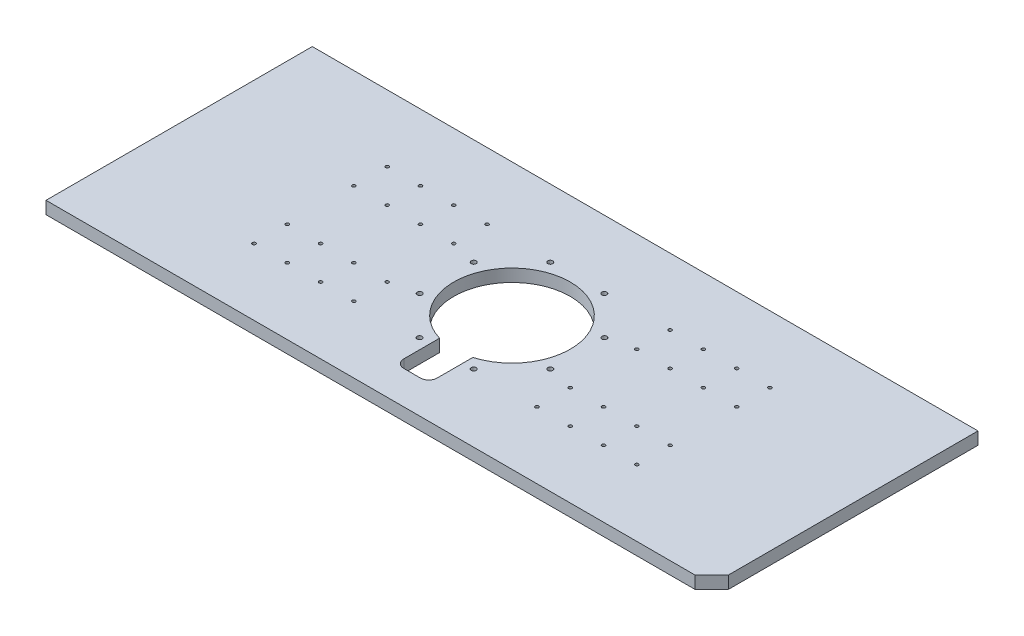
ISO-10303-21;
HEADER;
FILE_DESCRIPTION(('STEP AP214'),'2;1');
FILE_NAME('part.step','',(''),(''),'','','');
FILE_SCHEMA(('AUTOMOTIVE_DESIGN { 1 0 10303 214 1 1 1 1 }'));
ENDSEC;
DATA;
#1=APPLICATION_CONTEXT('core data for automotive mechanical design processes');
#2=APPLICATION_PROTOCOL_DEFINITION('international standard','automotive_design',2000,#1);
#3=PRODUCT_CONTEXT('',#1,'mechanical');
#4=PRODUCT('Part','Part','',(#3));
#5=PRODUCT_RELATED_PRODUCT_CATEGORY('part','',(#4));
#6=PRODUCT_DEFINITION_FORMATION('','',#4);
#7=PRODUCT_DEFINITION_CONTEXT('part definition',#1,'design');
#8=PRODUCT_DEFINITION('design','',#6,#7);
#9=PRODUCT_DEFINITION_SHAPE('','',#8);
#10=(LENGTH_UNIT() NAMED_UNIT(*) SI_UNIT(.MILLI.,.METRE.));
#11=(NAMED_UNIT(*) PLANE_ANGLE_UNIT() SI_UNIT($,.RADIAN.));
#12=(NAMED_UNIT(*) SI_UNIT($,.STERADIAN.) SOLID_ANGLE_UNIT());
#13=UNCERTAINTY_MEASURE_WITH_UNIT(LENGTH_MEASURE(1.E-05),#10,'distance_accuracy_value','');
#14=(GEOMETRIC_REPRESENTATION_CONTEXT(3) GLOBAL_UNCERTAINTY_ASSIGNED_CONTEXT((#13)) GLOBAL_UNIT_ASSIGNED_CONTEXT((#10,
#11,#12)) REPRESENTATION_CONTEXT('',''));
#15=CARTESIAN_POINT('',(0.,0.,0.));
#16=DIRECTION('',(0.,0.,1.));
#17=DIRECTION('',(1.,0.,0.));
#18=AXIS2_PLACEMENT_3D('',#15,#16,#17);
#19=CARTESIAN_POINT('',(-254.,9.525,-203.2));
#20=DIRECTION('',(1.,0.,0.));
#21=DIRECTION('',(0.,0.,-1.));
#22=AXIS2_PLACEMENT_3D('',#19,#20,#21);
#23=PLANE('',#22);
#24=DIRECTION('',(0.,0.,1.));
#25=VECTOR('',#24,1.);
#26=CARTESIAN_POINT('',(-254.,0.,-203.2));
#27=LINE('',#26,#25);
#28=CARTESIAN_POINT('',(-254.,0.,-203.2));
#29=VERTEX_POINT('',#28);
#30=CARTESIAN_POINT('',(-254.,0.,0.));
#31=VERTEX_POINT('',#30);
#32=EDGE_CURVE('E126',#29,#31,#27,.T.);
#33=ORIENTED_EDGE('',*,*,#32,.T.);
#34=DIRECTION('',(0.,-1.,0.));
#35=VECTOR('',#34,1.);
#36=CARTESIAN_POINT('',(-254.,9.525,0.));
#37=LINE('',#36,#35);
#38=CARTESIAN_POINT('',(-254.,9.525,0.));
#39=VERTEX_POINT('',#38);
#40=EDGE_CURVE('E178',#39,#31,#37,.T.);
#41=ORIENTED_EDGE('',*,*,#40,.F.);
#42=DIRECTION('',(0.,0.,1.));
#43=VECTOR('',#42,1.);
#44=CARTESIAN_POINT('',(-254.,9.525,-203.2));
#45=LINE('',#44,#43);
#46=CARTESIAN_POINT('',(-254.,9.525,-203.2));
#47=VERTEX_POINT('',#46);
#48=EDGE_CURVE('E162',#47,#39,#45,.T.);
#49=ORIENTED_EDGE('',*,*,#48,.F.);
#50=DIRECTION('',(0.,-1.,0.));
#51=VECTOR('',#50,1.);
#52=CARTESIAN_POINT('',(-254.,9.525,-203.2));
#53=LINE('',#52,#51);
#54=EDGE_CURVE('E172',#47,#29,#53,.T.);
#55=ORIENTED_EDGE('',*,*,#54,.T.);
#56=EDGE_LOOP('',(#33,#41,#49,#55));
#57=FACE_BOUND('',#56,.T.);
#58=ADVANCED_FACE('F29',(#57),#23,.F.);
#59=CARTESIAN_POINT('',(0.,9.525,0.));
#60=DIRECTION('',(0.,0.,-1.));
#61=DIRECTION('',(-1.,0.,0.));
#62=AXIS2_PLACEMENT_3D('',#59,#60,#61);
#63=PLANE('',#62);
#64=DIRECTION('',(1.,0.,0.));
#65=VECTOR('',#64,1.);
#66=CARTESIAN_POINT('',(0.,0.,0.));
#67=LINE('',#66,#65);
#68=CARTESIAN_POINT('',(241.3,0.,0.));
#69=VERTEX_POINT('',#68);
#70=EDGE_CURVE('E155',#31,#69,#67,.T.);
#71=ORIENTED_EDGE('',*,*,#70,.T.);
#72=DIRECTION('',(0.,1.,0.));
#73=VECTOR('',#72,1.);
#74=CARTESIAN_POINT('',(241.3,9.525,0.));
#75=LINE('',#74,#73);
#76=CARTESIAN_POINT('',(241.3,9.525,0.));
#77=VERTEX_POINT('',#76);
#78=EDGE_CURVE('E186',#69,#77,#75,.T.);
#79=ORIENTED_EDGE('',*,*,#78,.T.);
#80=DIRECTION('',(1.,0.,0.));
#81=VECTOR('',#80,1.);
#82=CARTESIAN_POINT('',(-254.,9.525,0.));
#83=LINE('',#82,#81);
#84=EDGE_CURVE('E165',#39,#77,#83,.T.);
#85=ORIENTED_EDGE('',*,*,#84,.F.);
#86=ORIENTED_EDGE('',*,*,#40,.T.);
#87=EDGE_LOOP('',(#71,#79,#85,#86));
#88=FACE_BOUND('',#87,.T.);
#89=ADVANCED_FACE('F222',(#88),#63,.F.);
#90=CARTESIAN_POINT('',(254.,9.525,-203.2));
#91=DIRECTION('',(-1.,0.,0.));
#92=DIRECTION('',(0.,0.,1.));
#93=AXIS2_PLACEMENT_3D('',#90,#91,#92);
#94=PLANE('',#93);
#95=DIRECTION('',(0.,0.,-1.));
#96=VECTOR('',#95,1.);
#97=CARTESIAN_POINT('',(254.,9.525,-203.2));
#98=LINE('',#97,#96);
#99=CARTESIAN_POINT('',(254.,9.525,-12.7000000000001));
#100=VERTEX_POINT('',#99);
#101=CARTESIAN_POINT('',(254.,9.525,-203.2));
#102=VERTEX_POINT('',#101);
#103=EDGE_CURVE('E168',#100,#102,#98,.T.);
#104=ORIENTED_EDGE('',*,*,#103,.F.);
#105=DIRECTION('',(0.,-1.,0.));
#106=VECTOR('',#105,1.);
#107=CARTESIAN_POINT('',(254.,9.525,-12.7));
#108=LINE('',#107,#106);
#109=CARTESIAN_POINT('',(254.,0.,-12.7000000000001));
#110=VERTEX_POINT('',#109);
#111=EDGE_CURVE('E181',#100,#110,#108,.T.);
#112=ORIENTED_EDGE('',*,*,#111,.T.);
#113=DIRECTION('',(0.,0.,-1.));
#114=VECTOR('',#113,1.);
#115=CARTESIAN_POINT('',(254.,0.,-203.2));
#116=LINE('',#115,#114);
#117=CARTESIAN_POINT('',(254.,0.,-203.2));
#118=VERTEX_POINT('',#117);
#119=EDGE_CURVE('E158',#110,#118,#116,.T.);
#120=ORIENTED_EDGE('',*,*,#119,.T.);
#121=DIRECTION('',(0.,-1.,0.));
#122=VECTOR('',#121,1.);
#123=CARTESIAN_POINT('',(254.,9.525,-203.2));
#124=LINE('',#123,#122);
#125=EDGE_CURVE('E175',#102,#118,#124,.T.);
#126=ORIENTED_EDGE('',*,*,#125,.F.);
#127=EDGE_LOOP('',(#104,#112,#120,#126));
#128=FACE_BOUND('',#127,.T.);
#129=ADVANCED_FACE('F228',(#128),#94,.F.);
#130=CARTESIAN_POINT('',(-254.,9.525,-203.2));
#131=DIRECTION('',(0.,0.,1.));
#132=DIRECTION('',(1.,0.,0.));
#133=AXIS2_PLACEMENT_3D('',#130,#131,#132);
#134=PLANE('',#133);
#135=DIRECTION('',(-1.,0.,0.));
#136=VECTOR('',#135,1.);
#137=CARTESIAN_POINT('',(-254.,0.,-203.2));
#138=LINE('',#137,#136);
#139=EDGE_CURVE('E160',#118,#29,#138,.T.);
#140=ORIENTED_EDGE('',*,*,#139,.T.);
#141=ORIENTED_EDGE('',*,*,#54,.F.);
#142=DIRECTION('',(-1.,0.,0.));
#143=VECTOR('',#142,1.);
#144=CARTESIAN_POINT('',(-254.,9.525,-203.2));
#145=LINE('',#144,#143);
#146=EDGE_CURVE('E170',#102,#47,#145,.T.);
#147=ORIENTED_EDGE('',*,*,#146,.F.);
#148=ORIENTED_EDGE('',*,*,#125,.T.);
#149=EDGE_LOOP('',(#140,#141,#147,#148));
#150=FACE_BOUND('',#149,.T.);
#151=ADVANCED_FACE('F244',(#150),#134,.F.);
#152=CARTESIAN_POINT('',(-254.,9.525,0.));
#153=DIRECTION('',(0.,1.,0.));
#154=DIRECTION('',(0.,0.,1.));
#155=AXIS2_PLACEMENT_3D('',#152,#153,#154);
#156=PLANE('',#155);
#157=CARTESIAN_POINT('',(146.05,9.525,-50.8));
#158=DIRECTION('',(0.,-1.,0.));
#159=DIRECTION('',(0.,0.,1.));
#160=AXIS2_PLACEMENT_3D('',#157,#158,#159);
#161=CIRCLE('',#160,1.26999999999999);
#162=CARTESIAN_POINT('',(146.05,9.525,-49.53));
#163=VERTEX_POINT('',#162);
#164=EDGE_CURVE('E953',#163,#163,#161,.T.);
#165=ORIENTED_EDGE('',*,*,#164,.T.);
#166=EDGE_LOOP('',(#165));
#167=FACE_BOUND('',#166,.T.);
#168=CARTESIAN_POINT('',(146.05,9.525,-152.4));
#169=DIRECTION('',(0.,-1.,0.));
#170=DIRECTION('',(0.,0.,1.));
#171=AXIS2_PLACEMENT_3D('',#168,#169,#170);
#172=CIRCLE('',#171,1.26999999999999);
#173=CARTESIAN_POINT('',(146.05,9.525,-151.13));
#174=VERTEX_POINT('',#173);
#175=EDGE_CURVE('E947',#174,#174,#172,.T.);
#176=ORIENTED_EDGE('',*,*,#175,.T.);
#177=EDGE_LOOP('',(#176));
#178=FACE_BOUND('',#177,.T.);
#179=CARTESIAN_POINT('',(120.65,9.525,-152.4));
#180=DIRECTION('',(0.,-1.,0.));
#181=DIRECTION('',(0.,0.,1.));
#182=AXIS2_PLACEMENT_3D('',#179,#180,#181);
#183=CIRCLE('',#182,1.26999999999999);
#184=CARTESIAN_POINT('',(120.65,9.525,-151.13));
#185=VERTEX_POINT('',#184);
#186=EDGE_CURVE('E941',#185,#185,#183,.T.);
#187=ORIENTED_EDGE('',*,*,#186,.T.);
#188=EDGE_LOOP('',(#187));
#189=FACE_BOUND('',#188,.T.);
#190=CARTESIAN_POINT('',(120.65,9.525,-76.2));
#191=DIRECTION('',(0.,-1.,0.));
#192=DIRECTION('',(0.,0.,1.));
#193=AXIS2_PLACEMENT_3D('',#190,#191,#192);
#194=CIRCLE('',#193,1.26999999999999);
#195=CARTESIAN_POINT('',(120.65,9.525,-74.93));
#196=VERTEX_POINT('',#195);
#197=EDGE_CURVE('E935',#196,#196,#194,.T.);
#198=ORIENTED_EDGE('',*,*,#197,.T.);
#199=EDGE_LOOP('',(#198));
#200=FACE_BOUND('',#199,.T.);
#201=CARTESIAN_POINT('',(146.05,9.525,-76.2));
#202=DIRECTION('',(0.,-1.,0.));
#203=DIRECTION('',(0.,0.,1.));
#204=AXIS2_PLACEMENT_3D('',#201,#202,#203);
#205=CIRCLE('',#204,1.26999999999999);
#206=CARTESIAN_POINT('',(146.05,9.525,-74.93));
#207=VERTEX_POINT('',#206);
#208=EDGE_CURVE('E929',#207,#207,#205,.T.);
#209=ORIENTED_EDGE('',*,*,#208,.T.);
#210=EDGE_LOOP('',(#209));
#211=FACE_BOUND('',#210,.T.);
#212=CARTESIAN_POINT('',(120.65,9.525,-127.));
#213=DIRECTION('',(0.,-1.,0.));
#214=DIRECTION('',(0.,0.,1.));
#215=AXIS2_PLACEMENT_3D('',#212,#213,#214);
#216=CIRCLE('',#215,1.26999999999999);
#217=CARTESIAN_POINT('',(120.65,9.525,-125.73));
#218=VERTEX_POINT('',#217);
#219=EDGE_CURVE('E923',#218,#218,#216,.T.);
#220=ORIENTED_EDGE('',*,*,#219,.T.);
#221=EDGE_LOOP('',(#220));
#222=FACE_BOUND('',#221,.T.);
#223=CARTESIAN_POINT('',(146.05,9.525,-127.));
#224=DIRECTION('',(0.,-1.,0.));
#225=DIRECTION('',(0.,0.,1.));
#226=AXIS2_PLACEMENT_3D('',#223,#224,#225);
#227=CIRCLE('',#226,1.26999999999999);
#228=CARTESIAN_POINT('',(146.05,9.525,-125.73));
#229=VERTEX_POINT('',#228);
#230=EDGE_CURVE('E917',#229,#229,#227,.T.);
#231=ORIENTED_EDGE('',*,*,#230,.T.);
#232=EDGE_LOOP('',(#231));
#233=FACE_BOUND('',#232,.T.);
#234=CARTESIAN_POINT('',(120.65,9.525,-50.8));
#235=DIRECTION('',(0.,-1.,0.));
#236=DIRECTION('',(0.,0.,1.));
#237=AXIS2_PLACEMENT_3D('',#234,#235,#236);
#238=CIRCLE('',#237,1.26999999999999);
#239=CARTESIAN_POINT('',(120.65,9.525,-49.53));
#240=VERTEX_POINT('',#239);
#241=EDGE_CURVE('E911',#240,#240,#238,.T.);
#242=ORIENTED_EDGE('',*,*,#241,.T.);
#243=EDGE_LOOP('',(#242));
#244=FACE_BOUND('',#243,.T.);
#245=CARTESIAN_POINT('',(69.85,9.525,-50.8));
#246=DIRECTION('',(0.,1.,0.));
#247=DIRECTION('',(0.,0.,1.));
#248=AXIS2_PLACEMENT_3D('',#245,#246,#247);
#249=CIRCLE('',#248,1.26999999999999);
#250=CARTESIAN_POINT('',(69.85,9.525,-49.53));
#251=VERTEX_POINT('',#250);
#252=EDGE_CURVE('E905',#251,#251,#249,.T.);
#253=ORIENTED_EDGE('',*,*,#252,.F.);
#254=EDGE_LOOP('',(#253));
#255=FACE_BOUND('',#254,.T.);
#256=CARTESIAN_POINT('',(95.25,9.525,-50.8));
#257=DIRECTION('',(0.,1.,0.));
#258=DIRECTION('',(0.,0.,1.));
#259=AXIS2_PLACEMENT_3D('',#256,#257,#258);
#260=CIRCLE('',#259,1.26999999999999);
#261=CARTESIAN_POINT('',(95.25,9.525,-49.53));
#262=VERTEX_POINT('',#261);
#263=EDGE_CURVE('E899',#262,#262,#260,.T.);
#264=ORIENTED_EDGE('',*,*,#263,.F.);
#265=EDGE_LOOP('',(#264));
#266=FACE_BOUND('',#265,.T.);
#267=CARTESIAN_POINT('',(95.25,9.525,-152.4));
#268=DIRECTION('',(0.,1.,0.));
#269=DIRECTION('',(0.,0.,1.));
#270=AXIS2_PLACEMENT_3D('',#267,#268,#269);
#271=CIRCLE('',#270,1.26999999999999);
#272=CARTESIAN_POINT('',(95.25,9.525,-151.13));
#273=VERTEX_POINT('',#272);
#274=EDGE_CURVE('E893',#273,#273,#271,.T.);
#275=ORIENTED_EDGE('',*,*,#274,.F.);
#276=EDGE_LOOP('',(#275));
#277=FACE_BOUND('',#276,.T.);
#278=CARTESIAN_POINT('',(69.85,9.525,-152.4));
#279=DIRECTION('',(0.,1.,0.));
#280=DIRECTION('',(0.,0.,1.));
#281=AXIS2_PLACEMENT_3D('',#278,#279,#280);
#282=CIRCLE('',#281,1.26999999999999);
#283=CARTESIAN_POINT('',(69.85,9.525,-151.13));
#284=VERTEX_POINT('',#283);
#285=EDGE_CURVE('E887',#284,#284,#282,.T.);
#286=ORIENTED_EDGE('',*,*,#285,.F.);
#287=EDGE_LOOP('',(#286));
#288=FACE_BOUND('',#287,.T.);
#289=CARTESIAN_POINT('',(69.85,9.525,-76.2));
#290=DIRECTION('',(0.,1.,0.));
#291=DIRECTION('',(0.,0.,1.));
#292=AXIS2_PLACEMENT_3D('',#289,#290,#291);
#293=CIRCLE('',#292,1.26999999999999);
#294=CARTESIAN_POINT('',(69.85,9.525,-74.93));
#295=VERTEX_POINT('',#294);
#296=EDGE_CURVE('E881',#295,#295,#293,.T.);
#297=ORIENTED_EDGE('',*,*,#296,.F.);
#298=EDGE_LOOP('',(#297));
#299=FACE_BOUND('',#298,.T.);
#300=CARTESIAN_POINT('',(95.25,9.525,-76.2));
#301=DIRECTION('',(0.,1.,0.));
#302=DIRECTION('',(0.,0.,1.));
#303=AXIS2_PLACEMENT_3D('',#300,#301,#302);
#304=CIRCLE('',#303,1.26999999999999);
#305=CARTESIAN_POINT('',(95.25,9.525,-74.93));
#306=VERTEX_POINT('',#305);
#307=EDGE_CURVE('E875',#306,#306,#304,.T.);
#308=ORIENTED_EDGE('',*,*,#307,.F.);
#309=EDGE_LOOP('',(#308));
#310=FACE_BOUND('',#309,.T.);
#311=CARTESIAN_POINT('',(69.85,9.525,-127.));
#312=DIRECTION('',(0.,1.,0.));
#313=DIRECTION('',(0.,0.,1.));
#314=AXIS2_PLACEMENT_3D('',#311,#312,#313);
#315=CIRCLE('',#314,1.26999999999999);
#316=CARTESIAN_POINT('',(69.85,9.525,-125.73));
#317=VERTEX_POINT('',#316);
#318=EDGE_CURVE('E869',#317,#317,#315,.T.);
#319=ORIENTED_EDGE('',*,*,#318,.F.);
#320=EDGE_LOOP('',(#319));
#321=FACE_BOUND('',#320,.T.);
#322=CARTESIAN_POINT('',(95.25,9.525,-127.));
#323=DIRECTION('',(0.,1.,0.));
#324=DIRECTION('',(0.,0.,1.));
#325=AXIS2_PLACEMENT_3D('',#322,#323,#324);
#326=CIRCLE('',#325,1.26999999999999);
#327=CARTESIAN_POINT('',(95.25,9.525,-125.73));
#328=VERTEX_POINT('',#327);
#329=EDGE_CURVE('E863',#328,#328,#326,.T.);
#330=ORIENTED_EDGE('',*,*,#329,.F.);
#331=EDGE_LOOP('',(#330));
#332=FACE_BOUND('',#331,.T.);
#333=CARTESIAN_POINT('',(-146.05,9.525,-50.8));
#334=DIRECTION('',(0.,1.,0.));
#335=DIRECTION('',(0.,0.,1.));
#336=AXIS2_PLACEMENT_3D('',#333,#334,#335);
#337=CIRCLE('',#336,1.26999999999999);
#338=CARTESIAN_POINT('',(-146.05,9.525,-49.53));
#339=VERTEX_POINT('',#338);
#340=EDGE_CURVE('E857',#339,#339,#337,.T.);
#341=ORIENTED_EDGE('',*,*,#340,.F.);
#342=EDGE_LOOP('',(#341));
#343=FACE_BOUND('',#342,.T.);
#344=CARTESIAN_POINT('',(-146.05,9.525,-152.4));
#345=DIRECTION('',(0.,1.,0.));
#346=DIRECTION('',(0.,0.,1.));
#347=AXIS2_PLACEMENT_3D('',#344,#345,#346);
#348=CIRCLE('',#347,1.26999999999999);
#349=CARTESIAN_POINT('',(-146.05,9.525,-151.13));
#350=VERTEX_POINT('',#349);
#351=EDGE_CURVE('E851',#350,#350,#348,.T.);
#352=ORIENTED_EDGE('',*,*,#351,.F.);
#353=EDGE_LOOP('',(#352));
#354=FACE_BOUND('',#353,.T.);
#355=CARTESIAN_POINT('',(-120.65,9.525,-152.4));
#356=DIRECTION('',(0.,1.,0.));
#357=DIRECTION('',(0.,0.,1.));
#358=AXIS2_PLACEMENT_3D('',#355,#356,#357);
#359=CIRCLE('',#358,1.26999999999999);
#360=CARTESIAN_POINT('',(-120.65,9.525,-151.13));
#361=VERTEX_POINT('',#360);
#362=EDGE_CURVE('E845',#361,#361,#359,.T.);
#363=ORIENTED_EDGE('',*,*,#362,.F.);
#364=EDGE_LOOP('',(#363));
#365=FACE_BOUND('',#364,.T.);
#366=CARTESIAN_POINT('',(-120.65,9.525,-76.2));
#367=DIRECTION('',(0.,1.,0.));
#368=DIRECTION('',(0.,0.,1.));
#369=AXIS2_PLACEMENT_3D('',#366,#367,#368);
#370=CIRCLE('',#369,1.26999999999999);
#371=CARTESIAN_POINT('',(-120.65,9.525,-74.93));
#372=VERTEX_POINT('',#371);
#373=EDGE_CURVE('E839',#372,#372,#370,.T.);
#374=ORIENTED_EDGE('',*,*,#373,.F.);
#375=EDGE_LOOP('',(#374));
#376=FACE_BOUND('',#375,.T.);
#377=CARTESIAN_POINT('',(-146.05,9.525,-76.2));
#378=DIRECTION('',(0.,1.,0.));
#379=DIRECTION('',(0.,0.,1.));
#380=AXIS2_PLACEMENT_3D('',#377,#378,#379);
#381=CIRCLE('',#380,1.26999999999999);
#382=CARTESIAN_POINT('',(-146.05,9.525,-74.93));
#383=VERTEX_POINT('',#382);
#384=EDGE_CURVE('E833',#383,#383,#381,.T.);
#385=ORIENTED_EDGE('',*,*,#384,.F.);
#386=EDGE_LOOP('',(#385));
#387=FACE_BOUND('',#386,.T.);
#388=CARTESIAN_POINT('',(-120.65,9.525,-127.));
#389=DIRECTION('',(0.,1.,0.));
#390=DIRECTION('',(0.,0.,1.));
#391=AXIS2_PLACEMENT_3D('',#388,#389,#390);
#392=CIRCLE('',#391,1.26999999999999);
#393=CARTESIAN_POINT('',(-120.65,9.525,-125.73));
#394=VERTEX_POINT('',#393);
#395=EDGE_CURVE('E477',#394,#394,#392,.T.);
#396=ORIENTED_EDGE('',*,*,#395,.F.);
#397=EDGE_LOOP('',(#396));
#398=FACE_BOUND('',#397,.T.);
#399=CARTESIAN_POINT('',(-146.05,9.525,-127.));
#400=DIRECTION('',(0.,1.,0.));
#401=DIRECTION('',(0.,0.,1.));
#402=AXIS2_PLACEMENT_3D('',#399,#400,#401);
#403=CIRCLE('',#402,1.26999999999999);
#404=CARTESIAN_POINT('',(-146.05,9.525,-125.73));
#405=VERTEX_POINT('',#404);
#406=EDGE_CURVE('E470',#405,#405,#403,.T.);
#407=ORIENTED_EDGE('',*,*,#406,.F.);
#408=EDGE_LOOP('',(#407));
#409=FACE_BOUND('',#408,.T.);
#410=CARTESIAN_POINT('',(-120.65,9.525,-50.8));
#411=DIRECTION('',(0.,1.,0.));
#412=DIRECTION('',(0.,0.,1.));
#413=AXIS2_PLACEMENT_3D('',#410,#411,#412);
#414=CIRCLE('',#413,1.26999999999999);
#415=CARTESIAN_POINT('',(-120.65,9.525,-49.53));
#416=VERTEX_POINT('',#415);
#417=EDGE_CURVE('E475',#416,#416,#414,.T.);
#418=ORIENTED_EDGE('',*,*,#417,.F.);
#419=EDGE_LOOP('',(#418));
#420=FACE_BOUND('',#419,.T.);
#421=CARTESIAN_POINT('',(-69.85,9.525,-50.8));
#422=DIRECTION('',(0.,1.,0.));
#423=DIRECTION('',(0.,0.,1.));
#424=AXIS2_PLACEMENT_3D('',#421,#422,#423);
#425=CIRCLE('',#424,1.26999999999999);
#426=CARTESIAN_POINT('',(-69.85,9.525,-49.53));
#427=VERTEX_POINT('',#426);
#428=EDGE_CURVE('E486',#427,#427,#425,.T.);
#429=ORIENTED_EDGE('',*,*,#428,.F.);
#430=EDGE_LOOP('',(#429));
#431=FACE_BOUND('',#430,.T.);
#432=CARTESIAN_POINT('',(-95.25,9.525,-50.8));
#433=DIRECTION('',(0.,1.,0.));
#434=DIRECTION('',(0.,0.,1.));
#435=AXIS2_PLACEMENT_3D('',#432,#433,#434);
#436=CIRCLE('',#435,1.26999999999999);
#437=CARTESIAN_POINT('',(-95.25,9.525,-49.53));
#438=VERTEX_POINT('',#437);
#439=EDGE_CURVE('E492',#438,#438,#436,.T.);
#440=ORIENTED_EDGE('',*,*,#439,.F.);
#441=EDGE_LOOP('',(#440));
#442=FACE_BOUND('',#441,.T.);
#443=CARTESIAN_POINT('',(-95.25,9.525,-152.4));
#444=DIRECTION('',(0.,1.,0.));
#445=DIRECTION('',(0.,0.,1.));
#446=AXIS2_PLACEMENT_3D('',#443,#444,#445);
#447=CIRCLE('',#446,1.26999999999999);
#448=CARTESIAN_POINT('',(-95.25,9.525,-151.13));
#449=VERTEX_POINT('',#448);
#450=EDGE_CURVE('E498',#449,#449,#447,.T.);
#451=ORIENTED_EDGE('',*,*,#450,.F.);
#452=EDGE_LOOP('',(#451));
#453=FACE_BOUND('',#452,.T.);
#454=CARTESIAN_POINT('',(-69.85,9.525,-152.4));
#455=DIRECTION('',(0.,1.,0.));
#456=DIRECTION('',(0.,0.,1.));
#457=AXIS2_PLACEMENT_3D('',#454,#455,#456);
#458=CIRCLE('',#457,1.26999999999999);
#459=CARTESIAN_POINT('',(-69.85,9.525,-151.13));
#460=VERTEX_POINT('',#459);
#461=EDGE_CURVE('E504',#460,#460,#458,.T.);
#462=ORIENTED_EDGE('',*,*,#461,.F.);
#463=EDGE_LOOP('',(#462));
#464=FACE_BOUND('',#463,.T.);
#465=CARTESIAN_POINT('',(-69.85,9.525,-76.2));
#466=DIRECTION('',(0.,1.,0.));
#467=DIRECTION('',(0.,0.,1.));
#468=AXIS2_PLACEMENT_3D('',#465,#466,#467);
#469=CIRCLE('',#468,1.26999999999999);
#470=CARTESIAN_POINT('',(-69.85,9.525,-74.93));
#471=VERTEX_POINT('',#470);
#472=EDGE_CURVE('E510',#471,#471,#469,.T.);
#473=ORIENTED_EDGE('',*,*,#472,.F.);
#474=EDGE_LOOP('',(#473));
#475=FACE_BOUND('',#474,.T.);
#476=CARTESIAN_POINT('',(-95.25,9.525,-76.2));
#477=DIRECTION('',(0.,1.,0.));
#478=DIRECTION('',(0.,0.,1.));
#479=AXIS2_PLACEMENT_3D('',#476,#477,#478);
#480=CIRCLE('',#479,1.26999999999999);
#481=CARTESIAN_POINT('',(-95.25,9.525,-74.93));
#482=VERTEX_POINT('',#481);
#483=EDGE_CURVE('E516',#482,#482,#480,.T.);
#484=ORIENTED_EDGE('',*,*,#483,.F.);
#485=EDGE_LOOP('',(#484));
#486=FACE_BOUND('',#485,.T.);
#487=CARTESIAN_POINT('',(-69.85,9.525,-127.));
#488=DIRECTION('',(0.,1.,0.));
#489=DIRECTION('',(0.,0.,1.));
#490=AXIS2_PLACEMENT_3D('',#487,#488,#489);
#491=CIRCLE('',#490,1.26999999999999);
#492=CARTESIAN_POINT('',(-69.85,9.525,-125.73));
#493=VERTEX_POINT('',#492);
#494=EDGE_CURVE('E522',#493,#493,#491,.T.);
#495=ORIENTED_EDGE('',*,*,#494,.F.);
#496=EDGE_LOOP('',(#495));
#497=FACE_BOUND('',#496,.T.);
#498=CARTESIAN_POINT('',(-95.25,9.525,-127.));
#499=DIRECTION('',(0.,1.,0.));
#500=DIRECTION('',(0.,0.,1.));
#501=AXIS2_PLACEMENT_3D('',#498,#499,#500);
#502=CIRCLE('',#501,1.26999999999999);
#503=CARTESIAN_POINT('',(-95.25,9.525,-125.73));
#504=VERTEX_POINT('',#503);
#505=EDGE_CURVE('E528',#504,#504,#502,.T.);
#506=ORIENTED_EDGE('',*,*,#505,.F.);
#507=EDGE_LOOP('',(#506));
#508=FACE_BOUND('',#507,.T.);
#509=CARTESIAN_POINT('',(20.6553382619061,9.525,-51.7336022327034));
#510=DIRECTION('',(0.,1.,0.));
#511=DIRECTION('',(0.,0.,1.));
#512=AXIS2_PLACEMENT_3D('',#509,#510,#511);
#513=CIRCLE('',#512,1.89864999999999);
#514=CARTESIAN_POINT('',(20.6553382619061,9.525,-49.8349522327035));
#515=VERTEX_POINT('',#514);
#516=EDGE_CURVE('E534',#515,#515,#513,.T.);
#517=ORIENTED_EDGE('',*,*,#516,.F.);
#518=EDGE_LOOP('',(#517));
#519=FACE_BOUND('',#518,.T.);
#520=CARTESIAN_POINT('',(-20.6553382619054,9.525,-51.7336022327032));
#521=DIRECTION('',(0.,1.,0.));
#522=DIRECTION('',(0.,0.,1.));
#523=AXIS2_PLACEMENT_3D('',#520,#521,#522);
#524=CIRCLE('',#523,1.89864999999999);
#525=CARTESIAN_POINT('',(-20.6553382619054,9.525,-49.8349522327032));
#526=VERTEX_POINT('',#525);
#527=EDGE_CURVE('E540',#526,#526,#524,.T.);
#528=ORIENTED_EDGE('',*,*,#527,.F.);
#529=EDGE_LOOP('',(#528));
#530=FACE_BOUND('',#529,.T.);
#531=CARTESIAN_POINT('',(-49.8663977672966,9.525,-80.9446617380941));
#532=DIRECTION('',(0.,1.,0.));
#533=DIRECTION('',(0.,0.,1.));
#534=AXIS2_PLACEMENT_3D('',#531,#532,#533);
#535=CIRCLE('',#534,1.89864999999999);
#536=CARTESIAN_POINT('',(-49.8663977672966,9.525,-79.0460117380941));
#537=VERTEX_POINT('',#536);
#538=EDGE_CURVE('E546',#537,#537,#535,.T.);
#539=ORIENTED_EDGE('',*,*,#538,.F.);
#540=EDGE_LOOP('',(#539));
#541=FACE_BOUND('',#540,.T.);
#542=CARTESIAN_POINT('',(-49.8663977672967,9.525,-122.255338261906));
#543=DIRECTION('',(0.,1.,0.));
#544=DIRECTION('',(0.,0.,1.));
#545=AXIS2_PLACEMENT_3D('',#542,#543,#544);
#546=CIRCLE('',#545,1.89864999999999);
#547=CARTESIAN_POINT('',(-49.8663977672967,9.525,-120.356688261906));
#548=VERTEX_POINT('',#547);
#549=EDGE_CURVE('E552',#548,#548,#546,.T.);
#550=ORIENTED_EDGE('',*,*,#549,.F.);
#551=EDGE_LOOP('',(#550));
#552=FACE_BOUND('',#551,.T.);
#553=CARTESIAN_POINT('',(-20.6553382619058,9.525,-151.466397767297));
#554=DIRECTION('',(0.,1.,0.));
#555=DIRECTION('',(0.,0.,1.));
#556=AXIS2_PLACEMENT_3D('',#553,#554,#555);
#557=CIRCLE('',#556,1.89864999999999);
#558=CARTESIAN_POINT('',(-20.6553382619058,9.525,-149.567747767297));
#559=VERTEX_POINT('',#558);
#560=EDGE_CURVE('E558',#559,#559,#557,.T.);
#561=ORIENTED_EDGE('',*,*,#560,.F.);
#562=EDGE_LOOP('',(#561));
#563=FACE_BOUND('',#562,.T.);
#564=CARTESIAN_POINT('',(20.6553382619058,9.525,-151.466397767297));
#565=DIRECTION('',(0.,1.,0.));
#566=DIRECTION('',(0.,0.,1.));
#567=AXIS2_PLACEMENT_3D('',#564,#565,#566);
#568=CIRCLE('',#567,1.89864999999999);
#569=CARTESIAN_POINT('',(20.6553382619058,9.525,-149.567747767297));
#570=VERTEX_POINT('',#569);
#571=EDGE_CURVE('E564',#570,#570,#568,.T.);
#572=ORIENTED_EDGE('',*,*,#571,.F.);
#573=EDGE_LOOP('',(#572));
#574=FACE_BOUND('',#573,.T.);
#575=CARTESIAN_POINT('',(49.8663977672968,9.525,-122.255338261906));
#576=DIRECTION('',(0.,1.,0.));
#577=DIRECTION('',(0.,0.,1.));
#578=AXIS2_PLACEMENT_3D('',#575,#576,#577);
#579=CIRCLE('',#578,1.89864999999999);
#580=CARTESIAN_POINT('',(49.8663977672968,9.525,-120.356688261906));
#581=VERTEX_POINT('',#580);
#582=EDGE_CURVE('E570',#581,#581,#579,.T.);
#583=ORIENTED_EDGE('',*,*,#582,.F.);
#584=EDGE_LOOP('',(#583));
#585=FACE_BOUND('',#584,.T.);
#586=CARTESIAN_POINT('',(49.8663977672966,9.525,-80.944661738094));
#587=DIRECTION('',(0.,1.,0.));
#588=DIRECTION('',(0.,0.,1.));
#589=AXIS2_PLACEMENT_3D('',#586,#587,#588);
#590=CIRCLE('',#589,1.89864999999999);
#591=CARTESIAN_POINT('',(49.8663977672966,9.525,-79.0460117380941));
#592=VERTEX_POINT('',#591);
#593=EDGE_CURVE('E134',#592,#592,#590,.T.);
#594=ORIENTED_EDGE('',*,*,#593,.F.);
#595=EDGE_LOOP('',(#594));
#596=FACE_BOUND('',#595,.T.);
#597=CARTESIAN_POINT('',(0.,9.525,-101.6));
#598=DIRECTION('',(0.,1.,0.));
#599=DIRECTION('',(0.,0.,1.));
#600=AXIS2_PLACEMENT_3D('',#597,#598,#599);
#601=CIRCLE('',#600,44.45);
#602=CARTESIAN_POINT('',(12.7,9.525,-59.002905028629));
#603=VERTEX_POINT('',#602);
#604=CARTESIAN_POINT('',(-12.7,9.525,-59.002905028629));
#605=VERTEX_POINT('',#604);
#606=EDGE_CURVE('E123',#603,#605,#601,.T.);
#607=ORIENTED_EDGE('',*,*,#606,.F.);
#608=DIRECTION('',(0.,0.,-1.));
#609=VECTOR('',#608,1.);
#610=CARTESIAN_POINT('',(12.7,9.525,-25.4));
#611=LINE('',#610,#609);
#612=CARTESIAN_POINT('',(12.7,9.525,-31.75));
#613=VERTEX_POINT('',#612);
#614=EDGE_CURVE('E110',#613,#603,#611,.T.);
#615=ORIENTED_EDGE('',*,*,#614,.F.);
#616=CARTESIAN_POINT('',(6.35,9.525,-31.75));
#617=DIRECTION('',(0.,1.,0.));
#618=DIRECTION('',(0.,0.,1.));
#619=AXIS2_PLACEMENT_3D('',#616,#617,#618);
#620=CIRCLE('',#619,6.35);
#621=CARTESIAN_POINT('',(6.35,9.525,-25.4));
#622=VERTEX_POINT('',#621);
#623=EDGE_CURVE('E36',#613,#622,#620,.F.);
#624=ORIENTED_EDGE('',*,*,#623,.T.);
#625=DIRECTION('',(1.,0.,0.));
#626=VECTOR('',#625,1.);
#627=CARTESIAN_POINT('',(12.7,9.525,-25.4));
#628=LINE('',#627,#626);
#629=CARTESIAN_POINT('',(-6.35,9.525,-25.4));
#630=VERTEX_POINT('',#629);
#631=EDGE_CURVE('E119',#630,#622,#628,.T.);
#632=ORIENTED_EDGE('',*,*,#631,.F.);
#633=CARTESIAN_POINT('',(-6.35,9.525,-31.75));
#634=DIRECTION('',(0.,1.,0.));
#635=DIRECTION('',(0.,0.,1.));
#636=AXIS2_PLACEMENT_3D('',#633,#634,#635);
#637=CIRCLE('',#636,6.35);
#638=CARTESIAN_POINT('',(-12.7,9.525,-31.75));
#639=VERTEX_POINT('',#638);
#640=EDGE_CURVE('E198',#630,#639,#637,.F.);
#641=ORIENTED_EDGE('',*,*,#640,.T.);
#642=DIRECTION('',(0.,0.,1.));
#643=VECTOR('',#642,1.);
#644=CARTESIAN_POINT('',(-12.7,9.525,-25.4));
#645=LINE('',#644,#643);
#646=EDGE_CURVE('E133',#605,#639,#645,.T.);
#647=ORIENTED_EDGE('',*,*,#646,.F.);
#648=EDGE_LOOP('',(#607,#615,#624,#632,#641,#647));
#649=FACE_BOUND('',#648,.T.);
#650=ORIENTED_EDGE('',*,*,#84,.T.);
#651=DIRECTION('',(-0.707106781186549,0.,0.707106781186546));
#652=VECTOR('',#651,1.);
#653=CARTESIAN_POINT('',(-6.35000000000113,9.525,247.65));
#654=LINE('',#653,#652);
#655=EDGE_CURVE('E188',#77,#100,#654,.F.);
#656=ORIENTED_EDGE('',*,*,#655,.T.);
#657=ORIENTED_EDGE('',*,*,#103,.T.);
#658=ORIENTED_EDGE('',*,*,#146,.T.);
#659=ORIENTED_EDGE('',*,*,#48,.T.);
#660=EDGE_LOOP('',(#650,#656,#657,#658,#659));
#661=FACE_BOUND('',#660,.T.);
#662=ADVANCED_FACE('F130',(#167,#178,#189,#200,#211,#222,#233,#244,#255,#266,#277,#288,#299,
#310,#321,#332,#343,#354,#365,#376,#387,#398,#409,#420,#431,#442,#453,#464,#475,#486,#497,#508,
#519,#530,#541,#552,#563,#574,#585,#596,#649,#661),#156,.T.);
#663=CARTESIAN_POINT('',(-254.,0.,0.));
#664=DIRECTION('',(0.,1.,0.));
#665=DIRECTION('',(0.,0.,1.));
#666=AXIS2_PLACEMENT_3D('',#663,#664,#665);
#667=PLANE('',#666);
#668=CARTESIAN_POINT('',(146.05,0.,-50.8));
#669=DIRECTION('',(0.,-1.,0.));
#670=DIRECTION('',(0.,0.,1.));
#671=AXIS2_PLACEMENT_3D('',#668,#669,#670);
#672=CIRCLE('',#671,1.26999999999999);
#673=CARTESIAN_POINT('',(146.05,0.,-49.53));
#674=VERTEX_POINT('',#673);
#675=EDGE_CURVE('E956',#674,#674,#672,.T.);
#676=ORIENTED_EDGE('',*,*,#675,.F.);
#677=EDGE_LOOP('',(#676));
#678=FACE_BOUND('',#677,.T.);
#679=CARTESIAN_POINT('',(146.05,0.,-152.4));
#680=DIRECTION('',(0.,-1.,0.));
#681=DIRECTION('',(0.,0.,1.));
#682=AXIS2_PLACEMENT_3D('',#679,#680,#681);
#683=CIRCLE('',#682,1.26999999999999);
#684=CARTESIAN_POINT('',(146.05,0.,-151.13));
#685=VERTEX_POINT('',#684);
#686=EDGE_CURVE('E950',#685,#685,#683,.T.);
#687=ORIENTED_EDGE('',*,*,#686,.F.);
#688=EDGE_LOOP('',(#687));
#689=FACE_BOUND('',#688,.T.);
#690=CARTESIAN_POINT('',(120.65,0.,-152.4));
#691=DIRECTION('',(0.,-1.,0.));
#692=DIRECTION('',(0.,0.,1.));
#693=AXIS2_PLACEMENT_3D('',#690,#691,#692);
#694=CIRCLE('',#693,1.26999999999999);
#695=CARTESIAN_POINT('',(120.65,0.,-151.13));
#696=VERTEX_POINT('',#695);
#697=EDGE_CURVE('E944',#696,#696,#694,.T.);
#698=ORIENTED_EDGE('',*,*,#697,.F.);
#699=EDGE_LOOP('',(#698));
#700=FACE_BOUND('',#699,.T.);
#701=CARTESIAN_POINT('',(120.65,0.,-76.2));
#702=DIRECTION('',(0.,-1.,0.));
#703=DIRECTION('',(0.,0.,1.));
#704=AXIS2_PLACEMENT_3D('',#701,#702,#703);
#705=CIRCLE('',#704,1.26999999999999);
#706=CARTESIAN_POINT('',(120.65,0.,-74.93));
#707=VERTEX_POINT('',#706);
#708=EDGE_CURVE('E938',#707,#707,#705,.T.);
#709=ORIENTED_EDGE('',*,*,#708,.F.);
#710=EDGE_LOOP('',(#709));
#711=FACE_BOUND('',#710,.T.);
#712=CARTESIAN_POINT('',(146.05,0.,-76.2));
#713=DIRECTION('',(0.,-1.,0.));
#714=DIRECTION('',(0.,0.,1.));
#715=AXIS2_PLACEMENT_3D('',#712,#713,#714);
#716=CIRCLE('',#715,1.26999999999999);
#717=CARTESIAN_POINT('',(146.05,0.,-74.93));
#718=VERTEX_POINT('',#717);
#719=EDGE_CURVE('E932',#718,#718,#716,.T.);
#720=ORIENTED_EDGE('',*,*,#719,.F.);
#721=EDGE_LOOP('',(#720));
#722=FACE_BOUND('',#721,.T.);
#723=CARTESIAN_POINT('',(120.65,0.,-127.));
#724=DIRECTION('',(0.,-1.,0.));
#725=DIRECTION('',(0.,0.,1.));
#726=AXIS2_PLACEMENT_3D('',#723,#724,#725);
#727=CIRCLE('',#726,1.26999999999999);
#728=CARTESIAN_POINT('',(120.65,0.,-125.73));
#729=VERTEX_POINT('',#728);
#730=EDGE_CURVE('E926',#729,#729,#727,.T.);
#731=ORIENTED_EDGE('',*,*,#730,.F.);
#732=EDGE_LOOP('',(#731));
#733=FACE_BOUND('',#732,.T.);
#734=CARTESIAN_POINT('',(146.05,0.,-127.));
#735=DIRECTION('',(0.,-1.,0.));
#736=DIRECTION('',(0.,0.,1.));
#737=AXIS2_PLACEMENT_3D('',#734,#735,#736);
#738=CIRCLE('',#737,1.26999999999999);
#739=CARTESIAN_POINT('',(146.05,0.,-125.73));
#740=VERTEX_POINT('',#739);
#741=EDGE_CURVE('E920',#740,#740,#738,.T.);
#742=ORIENTED_EDGE('',*,*,#741,.F.);
#743=EDGE_LOOP('',(#742));
#744=FACE_BOUND('',#743,.T.);
#745=CARTESIAN_POINT('',(120.65,0.,-50.8));
#746=DIRECTION('',(0.,-1.,0.));
#747=DIRECTION('',(0.,0.,1.));
#748=AXIS2_PLACEMENT_3D('',#745,#746,#747);
#749=CIRCLE('',#748,1.26999999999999);
#750=CARTESIAN_POINT('',(120.65,0.,-49.53));
#751=VERTEX_POINT('',#750);
#752=EDGE_CURVE('E914',#751,#751,#749,.T.);
#753=ORIENTED_EDGE('',*,*,#752,.F.);
#754=EDGE_LOOP('',(#753));
#755=FACE_BOUND('',#754,.T.);
#756=CARTESIAN_POINT('',(69.85,0.,-50.8));
#757=DIRECTION('',(0.,1.,0.));
#758=DIRECTION('',(0.,0.,1.));
#759=AXIS2_PLACEMENT_3D('',#756,#757,#758);
#760=CIRCLE('',#759,1.26999999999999);
#761=CARTESIAN_POINT('',(69.85,0.,-49.53));
#762=VERTEX_POINT('',#761);
#763=EDGE_CURVE('E908',#762,#762,#760,.T.);
#764=ORIENTED_EDGE('',*,*,#763,.T.);
#765=EDGE_LOOP('',(#764));
#766=FACE_BOUND('',#765,.T.);
#767=CARTESIAN_POINT('',(95.25,0.,-50.8));
#768=DIRECTION('',(0.,1.,0.));
#769=DIRECTION('',(0.,0.,1.));
#770=AXIS2_PLACEMENT_3D('',#767,#768,#769);
#771=CIRCLE('',#770,1.26999999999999);
#772=CARTESIAN_POINT('',(95.25,0.,-49.53));
#773=VERTEX_POINT('',#772);
#774=EDGE_CURVE('E902',#773,#773,#771,.T.);
#775=ORIENTED_EDGE('',*,*,#774,.T.);
#776=EDGE_LOOP('',(#775));
#777=FACE_BOUND('',#776,.T.);
#778=CARTESIAN_POINT('',(95.25,0.,-152.4));
#779=DIRECTION('',(0.,1.,0.));
#780=DIRECTION('',(0.,0.,1.));
#781=AXIS2_PLACEMENT_3D('',#778,#779,#780);
#782=CIRCLE('',#781,1.26999999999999);
#783=CARTESIAN_POINT('',(95.25,0.,-151.13));
#784=VERTEX_POINT('',#783);
#785=EDGE_CURVE('E896',#784,#784,#782,.T.);
#786=ORIENTED_EDGE('',*,*,#785,.T.);
#787=EDGE_LOOP('',(#786));
#788=FACE_BOUND('',#787,.T.);
#789=CARTESIAN_POINT('',(69.85,0.,-152.4));
#790=DIRECTION('',(0.,1.,0.));
#791=DIRECTION('',(0.,0.,1.));
#792=AXIS2_PLACEMENT_3D('',#789,#790,#791);
#793=CIRCLE('',#792,1.26999999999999);
#794=CARTESIAN_POINT('',(69.85,0.,-151.13));
#795=VERTEX_POINT('',#794);
#796=EDGE_CURVE('E890',#795,#795,#793,.T.);
#797=ORIENTED_EDGE('',*,*,#796,.T.);
#798=EDGE_LOOP('',(#797));
#799=FACE_BOUND('',#798,.T.);
#800=CARTESIAN_POINT('',(69.85,0.,-76.2));
#801=DIRECTION('',(0.,1.,0.));
#802=DIRECTION('',(0.,0.,1.));
#803=AXIS2_PLACEMENT_3D('',#800,#801,#802);
#804=CIRCLE('',#803,1.26999999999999);
#805=CARTESIAN_POINT('',(69.85,0.,-74.93));
#806=VERTEX_POINT('',#805);
#807=EDGE_CURVE('E884',#806,#806,#804,.T.);
#808=ORIENTED_EDGE('',*,*,#807,.T.);
#809=EDGE_LOOP('',(#808));
#810=FACE_BOUND('',#809,.T.);
#811=CARTESIAN_POINT('',(95.25,0.,-76.2));
#812=DIRECTION('',(0.,1.,0.));
#813=DIRECTION('',(0.,0.,1.));
#814=AXIS2_PLACEMENT_3D('',#811,#812,#813);
#815=CIRCLE('',#814,1.26999999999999);
#816=CARTESIAN_POINT('',(95.25,0.,-74.93));
#817=VERTEX_POINT('',#816);
#818=EDGE_CURVE('E878',#817,#817,#815,.T.);
#819=ORIENTED_EDGE('',*,*,#818,.T.);
#820=EDGE_LOOP('',(#819));
#821=FACE_BOUND('',#820,.T.);
#822=CARTESIAN_POINT('',(69.85,0.,-127.));
#823=DIRECTION('',(0.,1.,0.));
#824=DIRECTION('',(0.,0.,1.));
#825=AXIS2_PLACEMENT_3D('',#822,#823,#824);
#826=CIRCLE('',#825,1.26999999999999);
#827=CARTESIAN_POINT('',(69.85,0.,-125.73));
#828=VERTEX_POINT('',#827);
#829=EDGE_CURVE('E872',#828,#828,#826,.T.);
#830=ORIENTED_EDGE('',*,*,#829,.T.);
#831=EDGE_LOOP('',(#830));
#832=FACE_BOUND('',#831,.T.);
#833=CARTESIAN_POINT('',(95.25,0.,-127.));
#834=DIRECTION('',(0.,1.,0.));
#835=DIRECTION('',(0.,0.,1.));
#836=AXIS2_PLACEMENT_3D('',#833,#834,#835);
#837=CIRCLE('',#836,1.26999999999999);
#838=CARTESIAN_POINT('',(95.25,0.,-125.73));
#839=VERTEX_POINT('',#838);
#840=EDGE_CURVE('E866',#839,#839,#837,.T.);
#841=ORIENTED_EDGE('',*,*,#840,.T.);
#842=EDGE_LOOP('',(#841));
#843=FACE_BOUND('',#842,.T.);
#844=CARTESIAN_POINT('',(-146.05,0.,-50.8));
#845=DIRECTION('',(0.,1.,0.));
#846=DIRECTION('',(0.,0.,1.));
#847=AXIS2_PLACEMENT_3D('',#844,#845,#846);
#848=CIRCLE('',#847,1.26999999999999);
#849=CARTESIAN_POINT('',(-146.05,0.,-49.53));
#850=VERTEX_POINT('',#849);
#851=EDGE_CURVE('E860',#850,#850,#848,.T.);
#852=ORIENTED_EDGE('',*,*,#851,.T.);
#853=EDGE_LOOP('',(#852));
#854=FACE_BOUND('',#853,.T.);
#855=CARTESIAN_POINT('',(-146.05,0.,-152.4));
#856=DIRECTION('',(0.,1.,0.));
#857=DIRECTION('',(0.,0.,1.));
#858=AXIS2_PLACEMENT_3D('',#855,#856,#857);
#859=CIRCLE('',#858,1.26999999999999);
#860=CARTESIAN_POINT('',(-146.05,0.,-151.13));
#861=VERTEX_POINT('',#860);
#862=EDGE_CURVE('E854',#861,#861,#859,.T.);
#863=ORIENTED_EDGE('',*,*,#862,.T.);
#864=EDGE_LOOP('',(#863));
#865=FACE_BOUND('',#864,.T.);
#866=CARTESIAN_POINT('',(-120.65,0.,-152.4));
#867=DIRECTION('',(0.,1.,0.));
#868=DIRECTION('',(0.,0.,1.));
#869=AXIS2_PLACEMENT_3D('',#866,#867,#868);
#870=CIRCLE('',#869,1.26999999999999);
#871=CARTESIAN_POINT('',(-120.65,0.,-151.13));
#872=VERTEX_POINT('',#871);
#873=EDGE_CURVE('E848',#872,#872,#870,.T.);
#874=ORIENTED_EDGE('',*,*,#873,.T.);
#875=EDGE_LOOP('',(#874));
#876=FACE_BOUND('',#875,.T.);
#877=CARTESIAN_POINT('',(-120.65,0.,-76.2));
#878=DIRECTION('',(0.,1.,0.));
#879=DIRECTION('',(0.,0.,1.));
#880=AXIS2_PLACEMENT_3D('',#877,#878,#879);
#881=CIRCLE('',#880,1.26999999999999);
#882=CARTESIAN_POINT('',(-120.65,0.,-74.93));
#883=VERTEX_POINT('',#882);
#884=EDGE_CURVE('E842',#883,#883,#881,.T.);
#885=ORIENTED_EDGE('',*,*,#884,.T.);
#886=EDGE_LOOP('',(#885));
#887=FACE_BOUND('',#886,.T.);
#888=CARTESIAN_POINT('',(-146.05,0.,-76.2));
#889=DIRECTION('',(0.,1.,0.));
#890=DIRECTION('',(0.,0.,1.));
#891=AXIS2_PLACEMENT_3D('',#888,#889,#890);
#892=CIRCLE('',#891,1.26999999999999);
#893=CARTESIAN_POINT('',(-146.05,0.,-74.93));
#894=VERTEX_POINT('',#893);
#895=EDGE_CURVE('E836',#894,#894,#892,.T.);
#896=ORIENTED_EDGE('',*,*,#895,.T.);
#897=EDGE_LOOP('',(#896));
#898=FACE_BOUND('',#897,.T.);
#899=CARTESIAN_POINT('',(-120.65,0.,-127.));
#900=DIRECTION('',(0.,1.,0.));
#901=DIRECTION('',(0.,0.,1.));
#902=AXIS2_PLACEMENT_3D('',#899,#900,#901);
#903=CIRCLE('',#902,1.26999999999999);
#904=CARTESIAN_POINT('',(-120.65,0.,-125.73));
#905=VERTEX_POINT('',#904);
#906=EDGE_CURVE('E830',#905,#905,#903,.T.);
#907=ORIENTED_EDGE('',*,*,#906,.T.);
#908=EDGE_LOOP('',(#907));
#909=FACE_BOUND('',#908,.T.);
#910=CARTESIAN_POINT('',(-146.05,0.,-127.));
#911=DIRECTION('',(0.,1.,0.));
#912=DIRECTION('',(0.,0.,1.));
#913=AXIS2_PLACEMENT_3D('',#910,#911,#912);
#914=CIRCLE('',#913,1.26999999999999);
#915=CARTESIAN_POINT('',(-146.05,0.,-125.73));
#916=VERTEX_POINT('',#915);
#917=EDGE_CURVE('E467',#916,#916,#914,.T.);
#918=ORIENTED_EDGE('',*,*,#917,.T.);
#919=EDGE_LOOP('',(#918));
#920=FACE_BOUND('',#919,.T.);
#921=CARTESIAN_POINT('',(-120.65,0.,-50.8));
#922=DIRECTION('',(0.,1.,0.));
#923=DIRECTION('',(0.,0.,1.));
#924=AXIS2_PLACEMENT_3D('',#921,#922,#923);
#925=CIRCLE('',#924,1.26999999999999);
#926=CARTESIAN_POINT('',(-120.65,0.,-49.53));
#927=VERTEX_POINT('',#926);
#928=EDGE_CURVE('E472',#927,#927,#925,.T.);
#929=ORIENTED_EDGE('',*,*,#928,.T.);
#930=EDGE_LOOP('',(#929));
#931=FACE_BOUND('',#930,.T.);
#932=CARTESIAN_POINT('',(-69.85,0.,-50.8));
#933=DIRECTION('',(0.,1.,0.));
#934=DIRECTION('',(0.,0.,1.));
#935=AXIS2_PLACEMENT_3D('',#932,#933,#934);
#936=CIRCLE('',#935,1.26999999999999);
#937=CARTESIAN_POINT('',(-69.85,0.,-49.53));
#938=VERTEX_POINT('',#937);
#939=EDGE_CURVE('E483',#938,#938,#936,.T.);
#940=ORIENTED_EDGE('',*,*,#939,.T.);
#941=EDGE_LOOP('',(#940));
#942=FACE_BOUND('',#941,.T.);
#943=CARTESIAN_POINT('',(-95.25,0.,-50.8));
#944=DIRECTION('',(0.,1.,0.));
#945=DIRECTION('',(0.,0.,1.));
#946=AXIS2_PLACEMENT_3D('',#943,#944,#945);
#947=CIRCLE('',#946,1.26999999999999);
#948=CARTESIAN_POINT('',(-95.25,0.,-49.53));
#949=VERTEX_POINT('',#948);
#950=EDGE_CURVE('E489',#949,#949,#947,.T.);
#951=ORIENTED_EDGE('',*,*,#950,.T.);
#952=EDGE_LOOP('',(#951));
#953=FACE_BOUND('',#952,.T.);
#954=CARTESIAN_POINT('',(-95.25,0.,-152.4));
#955=DIRECTION('',(0.,1.,0.));
#956=DIRECTION('',(0.,0.,1.));
#957=AXIS2_PLACEMENT_3D('',#954,#955,#956);
#958=CIRCLE('',#957,1.26999999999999);
#959=CARTESIAN_POINT('',(-95.25,0.,-151.13));
#960=VERTEX_POINT('',#959);
#961=EDGE_CURVE('E495',#960,#960,#958,.T.);
#962=ORIENTED_EDGE('',*,*,#961,.T.);
#963=EDGE_LOOP('',(#962));
#964=FACE_BOUND('',#963,.T.);
#965=CARTESIAN_POINT('',(-69.85,0.,-152.4));
#966=DIRECTION('',(0.,1.,0.));
#967=DIRECTION('',(0.,0.,1.));
#968=AXIS2_PLACEMENT_3D('',#965,#966,#967);
#969=CIRCLE('',#968,1.26999999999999);
#970=CARTESIAN_POINT('',(-69.85,0.,-151.13));
#971=VERTEX_POINT('',#970);
#972=EDGE_CURVE('E501',#971,#971,#969,.T.);
#973=ORIENTED_EDGE('',*,*,#972,.T.);
#974=EDGE_LOOP('',(#973));
#975=FACE_BOUND('',#974,.T.);
#976=CARTESIAN_POINT('',(-69.85,0.,-76.2));
#977=DIRECTION('',(0.,1.,0.));
#978=DIRECTION('',(0.,0.,1.));
#979=AXIS2_PLACEMENT_3D('',#976,#977,#978);
#980=CIRCLE('',#979,1.26999999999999);
#981=CARTESIAN_POINT('',(-69.85,0.,-74.93));
#982=VERTEX_POINT('',#981);
#983=EDGE_CURVE('E507',#982,#982,#980,.T.);
#984=ORIENTED_EDGE('',*,*,#983,.T.);
#985=EDGE_LOOP('',(#984));
#986=FACE_BOUND('',#985,.T.);
#987=CARTESIAN_POINT('',(-95.25,0.,-76.2));
#988=DIRECTION('',(0.,1.,0.));
#989=DIRECTION('',(0.,0.,1.));
#990=AXIS2_PLACEMENT_3D('',#987,#988,#989);
#991=CIRCLE('',#990,1.26999999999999);
#992=CARTESIAN_POINT('',(-95.25,0.,-74.93));
#993=VERTEX_POINT('',#992);
#994=EDGE_CURVE('E513',#993,#993,#991,.T.);
#995=ORIENTED_EDGE('',*,*,#994,.T.);
#996=EDGE_LOOP('',(#995));
#997=FACE_BOUND('',#996,.T.);
#998=CARTESIAN_POINT('',(-69.85,0.,-127.));
#999=DIRECTION('',(0.,1.,0.));
#1000=DIRECTION('',(0.,0.,1.));
#1001=AXIS2_PLACEMENT_3D('',#998,#999,#1000);
#1002=CIRCLE('',#1001,1.26999999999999);
#1003=CARTESIAN_POINT('',(-69.85,0.,-125.73));
#1004=VERTEX_POINT('',#1003);
#1005=EDGE_CURVE('E519',#1004,#1004,#1002,.T.);
#1006=ORIENTED_EDGE('',*,*,#1005,.T.);
#1007=EDGE_LOOP('',(#1006));
#1008=FACE_BOUND('',#1007,.T.);
#1009=CARTESIAN_POINT('',(-95.25,0.,-127.));
#1010=DIRECTION('',(0.,1.,0.));
#1011=DIRECTION('',(0.,0.,1.));
#1012=AXIS2_PLACEMENT_3D('',#1009,#1010,#1011);
#1013=CIRCLE('',#1012,1.26999999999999);
#1014=CARTESIAN_POINT('',(-95.25,0.,-125.73));
#1015=VERTEX_POINT('',#1014);
#1016=EDGE_CURVE('E525',#1015,#1015,#1013,.T.);
#1017=ORIENTED_EDGE('',*,*,#1016,.T.);
#1018=EDGE_LOOP('',(#1017));
#1019=FACE_BOUND('',#1018,.T.);
#1020=CARTESIAN_POINT('',(20.6553382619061,0.,-51.7336022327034));
#1021=DIRECTION('',(0.,1.,0.));
#1022=DIRECTION('',(0.,0.,1.));
#1023=AXIS2_PLACEMENT_3D('',#1020,#1021,#1022);
#1024=CIRCLE('',#1023,1.89864999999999);
#1025=CARTESIAN_POINT('',(20.6553382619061,0.,-49.8349522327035));
#1026=VERTEX_POINT('',#1025);
#1027=EDGE_CURVE('E531',#1026,#1026,#1024,.T.);
#1028=ORIENTED_EDGE('',*,*,#1027,.T.);
#1029=EDGE_LOOP('',(#1028));
#1030=FACE_BOUND('',#1029,.T.);
#1031=CARTESIAN_POINT('',(-20.6553382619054,0.,-51.7336022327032));
#1032=DIRECTION('',(0.,1.,0.));
#1033=DIRECTION('',(0.,0.,1.));
#1034=AXIS2_PLACEMENT_3D('',#1031,#1032,#1033);
#1035=CIRCLE('',#1034,1.89864999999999);
#1036=CARTESIAN_POINT('',(-20.6553382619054,0.,-49.8349522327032));
#1037=VERTEX_POINT('',#1036);
#1038=EDGE_CURVE('E537',#1037,#1037,#1035,.T.);
#1039=ORIENTED_EDGE('',*,*,#1038,.T.);
#1040=EDGE_LOOP('',(#1039));
#1041=FACE_BOUND('',#1040,.T.);
#1042=CARTESIAN_POINT('',(-49.8663977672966,0.,-80.9446617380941));
#1043=DIRECTION('',(0.,1.,0.));
#1044=DIRECTION('',(0.,0.,1.));
#1045=AXIS2_PLACEMENT_3D('',#1042,#1043,#1044);
#1046=CIRCLE('',#1045,1.89864999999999);
#1047=CARTESIAN_POINT('',(-49.8663977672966,0.,-79.0460117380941));
#1048=VERTEX_POINT('',#1047);
#1049=EDGE_CURVE('E543',#1048,#1048,#1046,.T.);
#1050=ORIENTED_EDGE('',*,*,#1049,.T.);
#1051=EDGE_LOOP('',(#1050));
#1052=FACE_BOUND('',#1051,.T.);
#1053=CARTESIAN_POINT('',(-49.8663977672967,0.,-122.255338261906));
#1054=DIRECTION('',(0.,1.,0.));
#1055=DIRECTION('',(0.,0.,1.));
#1056=AXIS2_PLACEMENT_3D('',#1053,#1054,#1055);
#1057=CIRCLE('',#1056,1.89864999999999);
#1058=CARTESIAN_POINT('',(-49.8663977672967,0.,-120.356688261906));
#1059=VERTEX_POINT('',#1058);
#1060=EDGE_CURVE('E549',#1059,#1059,#1057,.T.);
#1061=ORIENTED_EDGE('',*,*,#1060,.T.);
#1062=EDGE_LOOP('',(#1061));
#1063=FACE_BOUND('',#1062,.T.);
#1064=CARTESIAN_POINT('',(-20.6553382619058,0.,-151.466397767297));
#1065=DIRECTION('',(0.,1.,0.));
#1066=DIRECTION('',(0.,0.,1.));
#1067=AXIS2_PLACEMENT_3D('',#1064,#1065,#1066);
#1068=CIRCLE('',#1067,1.89864999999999);
#1069=CARTESIAN_POINT('',(-20.6553382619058,0.,-149.567747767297));
#1070=VERTEX_POINT('',#1069);
#1071=EDGE_CURVE('E555',#1070,#1070,#1068,.T.);
#1072=ORIENTED_EDGE('',*,*,#1071,.T.);
#1073=EDGE_LOOP('',(#1072));
#1074=FACE_BOUND('',#1073,.T.);
#1075=CARTESIAN_POINT('',(20.6553382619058,0.,-151.466397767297));
#1076=DIRECTION('',(0.,1.,0.));
#1077=DIRECTION('',(0.,0.,1.));
#1078=AXIS2_PLACEMENT_3D('',#1075,#1076,#1077);
#1079=CIRCLE('',#1078,1.89864999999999);
#1080=CARTESIAN_POINT('',(20.6553382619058,0.,-149.567747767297));
#1081=VERTEX_POINT('',#1080);
#1082=EDGE_CURVE('E561',#1081,#1081,#1079,.T.);
#1083=ORIENTED_EDGE('',*,*,#1082,.T.);
#1084=EDGE_LOOP('',(#1083));
#1085=FACE_BOUND('',#1084,.T.);
#1086=CARTESIAN_POINT('',(49.8663977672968,0.,-122.255338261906));
#1087=DIRECTION('',(0.,1.,0.));
#1088=DIRECTION('',(0.,0.,1.));
#1089=AXIS2_PLACEMENT_3D('',#1086,#1087,#1088);
#1090=CIRCLE('',#1089,1.89864999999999);
#1091=CARTESIAN_POINT('',(49.8663977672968,0.,-120.356688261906));
#1092=VERTEX_POINT('',#1091);
#1093=EDGE_CURVE('E567',#1092,#1092,#1090,.T.);
#1094=ORIENTED_EDGE('',*,*,#1093,.T.);
#1095=EDGE_LOOP('',(#1094));
#1096=FACE_BOUND('',#1095,.T.);
#1097=CARTESIAN_POINT('',(49.8663977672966,0.,-80.944661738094));
#1098=DIRECTION('',(0.,1.,0.));
#1099=DIRECTION('',(0.,0.,1.));
#1100=AXIS2_PLACEMENT_3D('',#1097,#1098,#1099);
#1101=CIRCLE('',#1100,1.89864999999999);
#1102=CARTESIAN_POINT('',(49.8663977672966,0.,-79.0460117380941));
#1103=VERTEX_POINT('',#1102);
#1104=EDGE_CURVE('E138',#1103,#1103,#1101,.T.);
#1105=ORIENTED_EDGE('',*,*,#1104,.T.);
#1106=EDGE_LOOP('',(#1105));
#1107=FACE_BOUND('',#1106,.T.);
#1108=DIRECTION('',(1.,0.,0.));
#1109=VECTOR('',#1108,1.);
#1110=CARTESIAN_POINT('',(12.7,0.,-25.4));
#1111=LINE('',#1110,#1109);
#1112=CARTESIAN_POINT('',(-6.35,0.,-25.4));
#1113=VERTEX_POINT('',#1112);
#1114=CARTESIAN_POINT('',(6.35,0.,-25.4));
#1115=VERTEX_POINT('',#1114);
#1116=EDGE_CURVE('E148',#1113,#1115,#1111,.T.);
#1117=ORIENTED_EDGE('',*,*,#1116,.T.);
#1118=CARTESIAN_POINT('',(6.35,0.,-31.75));
#1119=DIRECTION('',(0.,1.,0.));
#1120=DIRECTION('',(0.,0.,1.));
#1121=AXIS2_PLACEMENT_3D('',#1118,#1119,#1120);
#1122=CIRCLE('',#1121,6.35);
#1123=CARTESIAN_POINT('',(12.7,0.,-31.75));
#1124=VERTEX_POINT('',#1123);
#1125=EDGE_CURVE('E11',#1115,#1124,#1122,.T.);
#1126=ORIENTED_EDGE('',*,*,#1125,.T.);
#1127=DIRECTION('',(0.,0.,-1.));
#1128=VECTOR('',#1127,1.);
#1129=CARTESIAN_POINT('',(12.7,0.,-25.4));
#1130=LINE('',#1129,#1128);
#1131=CARTESIAN_POINT('',(12.7,0.,-59.002905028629));
#1132=VERTEX_POINT('',#1131);
#1133=EDGE_CURVE('E150',#1124,#1132,#1130,.T.);
#1134=ORIENTED_EDGE('',*,*,#1133,.T.);
#1135=CARTESIAN_POINT('',(0.,0.,-101.6));
#1136=DIRECTION('',(0.,1.,0.));
#1137=DIRECTION('',(0.,0.,1.));
#1138=AXIS2_PLACEMENT_3D('',#1135,#1136,#1137);
#1139=CIRCLE('',#1138,44.45);
#1140=CARTESIAN_POINT('',(-12.7,0.,-59.002905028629));
#1141=VERTEX_POINT('',#1140);
#1142=EDGE_CURVE('E118',#1132,#1141,#1139,.T.);
#1143=ORIENTED_EDGE('',*,*,#1142,.T.);
#1144=DIRECTION('',(0.,0.,1.));
#1145=VECTOR('',#1144,1.);
#1146=CARTESIAN_POINT('',(-12.7,0.,-25.4));
#1147=LINE('',#1146,#1145);
#1148=CARTESIAN_POINT('',(-12.7,0.,-31.75));
#1149=VERTEX_POINT('',#1148);
#1150=EDGE_CURVE('E145',#1141,#1149,#1147,.T.);
#1151=ORIENTED_EDGE('',*,*,#1150,.T.);
#1152=CARTESIAN_POINT('',(-6.35,0.,-31.75));
#1153=DIRECTION('',(0.,1.,0.));
#1154=DIRECTION('',(0.,0.,1.));
#1155=AXIS2_PLACEMENT_3D('',#1152,#1153,#1154);
#1156=CIRCLE('',#1155,6.35);
#1157=EDGE_CURVE('E200',#1149,#1113,#1156,.T.);
#1158=ORIENTED_EDGE('',*,*,#1157,.T.);
#1159=EDGE_LOOP('',(#1117,#1126,#1134,#1143,#1151,#1158));
#1160=FACE_BOUND('',#1159,.T.);
#1161=ORIENTED_EDGE('',*,*,#119,.F.);
#1162=DIRECTION('',(0.707106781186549,0.,-0.707106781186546));
#1163=VECTOR('',#1162,1.);
#1164=CARTESIAN_POINT('',(254.,0.,-12.7));
#1165=LINE('',#1164,#1163);
#1166=EDGE_CURVE('E184',#110,#69,#1165,.F.);
#1167=ORIENTED_EDGE('',*,*,#1166,.T.);
#1168=ORIENTED_EDGE('',*,*,#70,.F.);
#1169=ORIENTED_EDGE('',*,*,#32,.F.);
#1170=ORIENTED_EDGE('',*,*,#139,.F.);
#1171=EDGE_LOOP('',(#1161,#1167,#1168,#1169,#1170));
#1172=FACE_BOUND('',#1171,.T.);
#1173=ADVANCED_FACE('F237',(#678,#689,#700,#711,#722,#733,#744,#755,#766,#777,#788,#799,#810,
#821,#832,#843,#854,#865,#876,#887,#898,#909,#920,#931,#942,#953,#964,#975,#986,#997,#1008,
#1019,#1030,#1041,#1052,#1063,#1074,#1085,#1096,#1107,#1160,#1172),#667,.F.);
#1174=CARTESIAN_POINT('',(0.,0.,-101.6));
#1175=DIRECTION('',(0.,1.,0.));
#1176=DIRECTION('',(0.,0.,1.));
#1177=AXIS2_PLACEMENT_3D('',#1174,#1175,#1176);
#1178=CYLINDRICAL_SURFACE('',#1177,44.45);
#1179=ORIENTED_EDGE('',*,*,#606,.T.);
#1180=DIRECTION('',(0.,1.,0.));
#1181=VECTOR('',#1180,1.);
#1182=CARTESIAN_POINT('',(-12.7,0.,-59.002905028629));
#1183=LINE('',#1182,#1181);
#1184=EDGE_CURVE('E127',#1141,#605,#1183,.T.);
#1185=ORIENTED_EDGE('',*,*,#1184,.F.);
#1186=ORIENTED_EDGE('',*,*,#1142,.F.);
#1187=DIRECTION('',(0.,1.,0.));
#1188=VECTOR('',#1187,1.);
#1189=CARTESIAN_POINT('',(12.7,0.,-59.002905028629));
#1190=LINE('',#1189,#1188);
#1191=EDGE_CURVE('E113',#1132,#603,#1190,.T.);
#1192=ORIENTED_EDGE('',*,*,#1191,.T.);
#1193=EDGE_LOOP('',(#1179,#1185,#1186,#1192));
#1194=FACE_BOUND('',#1193,.T.);
#1195=ADVANCED_FACE('F122',(#1194),#1178,.F.);
#1196=CARTESIAN_POINT('',(12.7,0.,-25.4));
#1197=DIRECTION('',(1.,0.,0.));
#1198=DIRECTION('',(0.,0.,-1.));
#1199=AXIS2_PLACEMENT_3D('',#1196,#1197,#1198);
#1200=PLANE('',#1199);
#1201=ORIENTED_EDGE('',*,*,#1133,.F.);
#1202=DIRECTION('',(0.,1.,0.));
#1203=VECTOR('',#1202,1.);
#1204=CARTESIAN_POINT('',(12.7,9.525,-31.75));
#1205=LINE('',#1204,#1203);
#1206=EDGE_CURVE('E115',#1124,#613,#1205,.T.);
#1207=ORIENTED_EDGE('',*,*,#1206,.T.);
#1208=ORIENTED_EDGE('',*,*,#614,.T.);
#1209=ORIENTED_EDGE('',*,*,#1191,.F.);
#1210=EDGE_LOOP('',(#1201,#1207,#1208,#1209));
#1211=FACE_BOUND('',#1210,.T.);
#1212=ADVANCED_FACE('F112',(#1211),#1200,.F.);
#1213=CARTESIAN_POINT('',(12.7,0.,-25.4));
#1214=DIRECTION('',(0.,0.,1.));
#1215=DIRECTION('',(1.,0.,0.));
#1216=AXIS2_PLACEMENT_3D('',#1213,#1214,#1215);
#1217=PLANE('',#1216);
#1218=ORIENTED_EDGE('',*,*,#1116,.F.);
#1219=DIRECTION('',(0.,1.,0.));
#1220=VECTOR('',#1219,1.);
#1221=CARTESIAN_POINT('',(-6.35,9.525,-25.4));
#1222=LINE('',#1221,#1220);
#1223=EDGE_CURVE('E192',#1113,#630,#1222,.T.);
#1224=ORIENTED_EDGE('',*,*,#1223,.T.);
#1225=ORIENTED_EDGE('',*,*,#631,.T.);
#1226=DIRECTION('',(0.,1.,0.));
#1227=VECTOR('',#1226,1.);
#1228=CARTESIAN_POINT('',(6.35,0.,-25.4));
#1229=LINE('',#1228,#1227);
#1230=EDGE_CURVE('E190',#622,#1115,#1229,.F.);
#1231=ORIENTED_EDGE('',*,*,#1230,.T.);
#1232=EDGE_LOOP('',(#1218,#1224,#1225,#1231));
#1233=FACE_BOUND('',#1232,.T.);
#1234=ADVANCED_FACE('F204',(#1233),#1217,.F.);
#1235=CARTESIAN_POINT('',(-12.7,0.,-25.4));
#1236=DIRECTION('',(-1.,0.,0.));
#1237=DIRECTION('',(0.,0.,1.));
#1238=AXIS2_PLACEMENT_3D('',#1235,#1236,#1237);
#1239=PLANE('',#1238);
#1240=ORIENTED_EDGE('',*,*,#646,.T.);
#1241=DIRECTION('',(0.,1.,0.));
#1242=VECTOR('',#1241,1.);
#1243=CARTESIAN_POINT('',(-12.7,0.,-31.75));
#1244=LINE('',#1243,#1242);
#1245=EDGE_CURVE('E195',#639,#1149,#1244,.F.);
#1246=ORIENTED_EDGE('',*,*,#1245,.T.);
#1247=ORIENTED_EDGE('',*,*,#1150,.F.);
#1248=ORIENTED_EDGE('',*,*,#1184,.T.);
#1249=EDGE_LOOP('',(#1240,#1246,#1247,#1248));
#1250=FACE_BOUND('',#1249,.T.);
#1251=ADVANCED_FACE('F251',(#1250),#1239,.F.);
#1252=CARTESIAN_POINT('',(254.,9.525,-12.7));
#1253=DIRECTION('',(-0.707106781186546,0.,-0.707106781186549));
#1254=DIRECTION('',(-0.707106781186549,0.,0.707106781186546));
#1255=AXIS2_PLACEMENT_3D('',#1252,#1253,#1254);
#1256=PLANE('',#1255);
#1257=ORIENTED_EDGE('',*,*,#655,.F.);
#1258=ORIENTED_EDGE('',*,*,#78,.F.);
#1259=ORIENTED_EDGE('',*,*,#1166,.F.);
#1260=ORIENTED_EDGE('',*,*,#111,.F.);
#1261=EDGE_LOOP('',(#1257,#1258,#1259,#1260));
#1262=FACE_BOUND('',#1261,.T.);
#1263=ADVANCED_FACE('F248',(#1262),#1256,.F.);
#1264=CARTESIAN_POINT('',(49.8663977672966,9.525,-80.944661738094));
#1265=DIRECTION('',(0.,1.,0.));
#1266=DIRECTION('',(0.,0.,1.));
#1267=AXIS2_PLACEMENT_3D('',#1264,#1265,#1266);
#1268=CYLINDRICAL_SURFACE('',#1267,1.89864999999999);
#1269=ORIENTED_EDGE('',*,*,#1104,.F.);
#1270=EDGE_LOOP('',(#1269));
#1271=FACE_BOUND('',#1270,.T.);
#1272=ORIENTED_EDGE('',*,*,#593,.T.);
#1273=EDGE_LOOP('',(#1272));
#1274=FACE_BOUND('',#1273,.T.);
#1275=ADVANCED_FACE('F250',(#1271,#1274),#1268,.F.);
#1276=CARTESIAN_POINT('',(49.8663977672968,9.525,-122.255338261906));
#1277=DIRECTION('',(0.,1.,0.));
#1278=DIRECTION('',(0.,0.,1.));
#1279=AXIS2_PLACEMENT_3D('',#1276,#1277,#1278);
#1280=CYLINDRICAL_SURFACE('',#1279,1.89864999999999);
#1281=ORIENTED_EDGE('',*,*,#1093,.F.);
#1282=EDGE_LOOP('',(#1281));
#1283=FACE_BOUND('',#1282,.T.);
#1284=ORIENTED_EDGE('',*,*,#582,.T.);
#1285=EDGE_LOOP('',(#1284));
#1286=FACE_BOUND('',#1285,.T.);
#1287=ADVANCED_FACE('F257',(#1283,#1286),#1280,.F.);
#1288=CARTESIAN_POINT('',(20.6553382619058,9.525,-151.466397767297));
#1289=DIRECTION('',(0.,1.,0.));
#1290=DIRECTION('',(0.,0.,1.));
#1291=AXIS2_PLACEMENT_3D('',#1288,#1289,#1290);
#1292=CYLINDRICAL_SURFACE('',#1291,1.89864999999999);
#1293=ORIENTED_EDGE('',*,*,#1082,.F.);
#1294=EDGE_LOOP('',(#1293));
#1295=FACE_BOUND('',#1294,.T.);
#1296=ORIENTED_EDGE('',*,*,#571,.T.);
#1297=EDGE_LOOP('',(#1296));
#1298=FACE_BOUND('',#1297,.T.);
#1299=ADVANCED_FACE('F585',(#1295,#1298),#1292,.F.);
#1300=CARTESIAN_POINT('',(-20.6553382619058,9.525,-151.466397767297));
#1301=DIRECTION('',(0.,1.,0.));
#1302=DIRECTION('',(0.,0.,1.));
#1303=AXIS2_PLACEMENT_3D('',#1300,#1301,#1302);
#1304=CYLINDRICAL_SURFACE('',#1303,1.89864999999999);
#1305=ORIENTED_EDGE('',*,*,#1071,.F.);
#1306=EDGE_LOOP('',(#1305));
#1307=FACE_BOUND('',#1306,.T.);
#1308=ORIENTED_EDGE('',*,*,#560,.T.);
#1309=EDGE_LOOP('',(#1308));
#1310=FACE_BOUND('',#1309,.T.);
#1311=ADVANCED_FACE('F590',(#1307,#1310),#1304,.F.);
#1312=CARTESIAN_POINT('',(-49.8663977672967,9.525,-122.255338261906));
#1313=DIRECTION('',(0.,1.,0.));
#1314=DIRECTION('',(0.,0.,1.));
#1315=AXIS2_PLACEMENT_3D('',#1312,#1313,#1314);
#1316=CYLINDRICAL_SURFACE('',#1315,1.89864999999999);
#1317=ORIENTED_EDGE('',*,*,#1060,.F.);
#1318=EDGE_LOOP('',(#1317));
#1319=FACE_BOUND('',#1318,.T.);
#1320=ORIENTED_EDGE('',*,*,#549,.T.);
#1321=EDGE_LOOP('',(#1320));
#1322=FACE_BOUND('',#1321,.T.);
#1323=ADVANCED_FACE('F597',(#1319,#1322),#1316,.F.);
#1324=CARTESIAN_POINT('',(-49.8663977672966,9.525,-80.9446617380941));
#1325=DIRECTION('',(0.,1.,0.));
#1326=DIRECTION('',(0.,0.,1.));
#1327=AXIS2_PLACEMENT_3D('',#1324,#1325,#1326);
#1328=CYLINDRICAL_SURFACE('',#1327,1.89864999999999);
#1329=ORIENTED_EDGE('',*,*,#1049,.F.);
#1330=EDGE_LOOP('',(#1329));
#1331=FACE_BOUND('',#1330,.T.);
#1332=ORIENTED_EDGE('',*,*,#538,.T.);
#1333=EDGE_LOOP('',(#1332));
#1334=FACE_BOUND('',#1333,.T.);
#1335=ADVANCED_FACE('F601',(#1331,#1334),#1328,.F.);
#1336=CARTESIAN_POINT('',(-20.6553382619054,9.525,-51.7336022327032));
#1337=DIRECTION('',(0.,1.,0.));
#1338=DIRECTION('',(0.,0.,1.));
#1339=AXIS2_PLACEMENT_3D('',#1336,#1337,#1338);
#1340=CYLINDRICAL_SURFACE('',#1339,1.89864999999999);
#1341=ORIENTED_EDGE('',*,*,#1038,.F.);
#1342=EDGE_LOOP('',(#1341));
#1343=FACE_BOUND('',#1342,.T.);
#1344=ORIENTED_EDGE('',*,*,#527,.T.);
#1345=EDGE_LOOP('',(#1344));
#1346=FACE_BOUND('',#1345,.T.);
#1347=ADVANCED_FACE('F605',(#1343,#1346),#1340,.F.);
#1348=CARTESIAN_POINT('',(20.6553382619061,9.525,-51.7336022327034));
#1349=DIRECTION('',(0.,1.,0.));
#1350=DIRECTION('',(0.,0.,1.));
#1351=AXIS2_PLACEMENT_3D('',#1348,#1349,#1350);
#1352=CYLINDRICAL_SURFACE('',#1351,1.89864999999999);
#1353=ORIENTED_EDGE('',*,*,#1027,.F.);
#1354=EDGE_LOOP('',(#1353));
#1355=FACE_BOUND('',#1354,.T.);
#1356=ORIENTED_EDGE('',*,*,#516,.T.);
#1357=EDGE_LOOP('',(#1356));
#1358=FACE_BOUND('',#1357,.T.);
#1359=ADVANCED_FACE('F609',(#1355,#1358),#1352,.F.);
#1360=CARTESIAN_POINT('',(-95.25,9.525,-127.));
#1361=DIRECTION('',(0.,1.,0.));
#1362=DIRECTION('',(0.,0.,1.));
#1363=AXIS2_PLACEMENT_3D('',#1360,#1361,#1362);
#1364=CYLINDRICAL_SURFACE('',#1363,1.26999999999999);
#1365=ORIENTED_EDGE('',*,*,#1016,.F.);
#1366=EDGE_LOOP('',(#1365));
#1367=FACE_BOUND('',#1366,.T.);
#1368=ORIENTED_EDGE('',*,*,#505,.T.);
#1369=EDGE_LOOP('',(#1368));
#1370=FACE_BOUND('',#1369,.T.);
#1371=ADVANCED_FACE('F613',(#1367,#1370),#1364,.F.);
#1372=CARTESIAN_POINT('',(-69.85,9.525,-127.));
#1373=DIRECTION('',(0.,1.,0.));
#1374=DIRECTION('',(0.,0.,1.));
#1375=AXIS2_PLACEMENT_3D('',#1372,#1373,#1374);
#1376=CYLINDRICAL_SURFACE('',#1375,1.26999999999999);
#1377=ORIENTED_EDGE('',*,*,#1005,.F.);
#1378=EDGE_LOOP('',(#1377));
#1379=FACE_BOUND('',#1378,.T.);
#1380=ORIENTED_EDGE('',*,*,#494,.T.);
#1381=EDGE_LOOP('',(#1380));
#1382=FACE_BOUND('',#1381,.T.);
#1383=ADVANCED_FACE('F617',(#1379,#1382),#1376,.F.);
#1384=CARTESIAN_POINT('',(-95.25,9.525,-76.2));
#1385=DIRECTION('',(0.,1.,0.));
#1386=DIRECTION('',(0.,0.,1.));
#1387=AXIS2_PLACEMENT_3D('',#1384,#1385,#1386);
#1388=CYLINDRICAL_SURFACE('',#1387,1.26999999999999);
#1389=ORIENTED_EDGE('',*,*,#994,.F.);
#1390=EDGE_LOOP('',(#1389));
#1391=FACE_BOUND('',#1390,.T.);
#1392=ORIENTED_EDGE('',*,*,#483,.T.);
#1393=EDGE_LOOP('',(#1392));
#1394=FACE_BOUND('',#1393,.T.);
#1395=ADVANCED_FACE('F621',(#1391,#1394),#1388,.F.);
#1396=CARTESIAN_POINT('',(-69.85,9.525,-76.2));
#1397=DIRECTION('',(0.,1.,0.));
#1398=DIRECTION('',(0.,0.,1.));
#1399=AXIS2_PLACEMENT_3D('',#1396,#1397,#1398);
#1400=CYLINDRICAL_SURFACE('',#1399,1.26999999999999);
#1401=ORIENTED_EDGE('',*,*,#983,.F.);
#1402=EDGE_LOOP('',(#1401));
#1403=FACE_BOUND('',#1402,.T.);
#1404=ORIENTED_EDGE('',*,*,#472,.T.);
#1405=EDGE_LOOP('',(#1404));
#1406=FACE_BOUND('',#1405,.T.);
#1407=ADVANCED_FACE('F625',(#1403,#1406),#1400,.F.);
#1408=CARTESIAN_POINT('',(-69.85,9.525,-152.4));
#1409=DIRECTION('',(0.,1.,0.));
#1410=DIRECTION('',(0.,0.,1.));
#1411=AXIS2_PLACEMENT_3D('',#1408,#1409,#1410);
#1412=CYLINDRICAL_SURFACE('',#1411,1.26999999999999);
#1413=ORIENTED_EDGE('',*,*,#972,.F.);
#1414=EDGE_LOOP('',(#1413));
#1415=FACE_BOUND('',#1414,.T.);
#1416=ORIENTED_EDGE('',*,*,#461,.T.);
#1417=EDGE_LOOP('',(#1416));
#1418=FACE_BOUND('',#1417,.T.);
#1419=ADVANCED_FACE('F629',(#1415,#1418),#1412,.F.);
#1420=CARTESIAN_POINT('',(-95.25,9.525,-152.4));
#1421=DIRECTION('',(0.,1.,0.));
#1422=DIRECTION('',(0.,0.,1.));
#1423=AXIS2_PLACEMENT_3D('',#1420,#1421,#1422);
#1424=CYLINDRICAL_SURFACE('',#1423,1.26999999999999);
#1425=ORIENTED_EDGE('',*,*,#961,.F.);
#1426=EDGE_LOOP('',(#1425));
#1427=FACE_BOUND('',#1426,.T.);
#1428=ORIENTED_EDGE('',*,*,#450,.T.);
#1429=EDGE_LOOP('',(#1428));
#1430=FACE_BOUND('',#1429,.T.);
#1431=ADVANCED_FACE('F633',(#1427,#1430),#1424,.F.);
#1432=CARTESIAN_POINT('',(-95.25,9.525,-50.8));
#1433=DIRECTION('',(0.,1.,0.));
#1434=DIRECTION('',(0.,0.,1.));
#1435=AXIS2_PLACEMENT_3D('',#1432,#1433,#1434);
#1436=CYLINDRICAL_SURFACE('',#1435,1.26999999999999);
#1437=ORIENTED_EDGE('',*,*,#950,.F.);
#1438=EDGE_LOOP('',(#1437));
#1439=FACE_BOUND('',#1438,.T.);
#1440=ORIENTED_EDGE('',*,*,#439,.T.);
#1441=EDGE_LOOP('',(#1440));
#1442=FACE_BOUND('',#1441,.T.);
#1443=ADVANCED_FACE('F637',(#1439,#1442),#1436,.F.);
#1444=CARTESIAN_POINT('',(-69.85,9.525,-50.8));
#1445=DIRECTION('',(0.,1.,0.));
#1446=DIRECTION('',(0.,0.,1.));
#1447=AXIS2_PLACEMENT_3D('',#1444,#1445,#1446);
#1448=CYLINDRICAL_SURFACE('',#1447,1.26999999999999);
#1449=ORIENTED_EDGE('',*,*,#939,.F.);
#1450=EDGE_LOOP('',(#1449));
#1451=FACE_BOUND('',#1450,.T.);
#1452=ORIENTED_EDGE('',*,*,#428,.T.);
#1453=EDGE_LOOP('',(#1452));
#1454=FACE_BOUND('',#1453,.T.);
#1455=ADVANCED_FACE('F218',(#1451,#1454),#1448,.F.);
#1456=CARTESIAN_POINT('',(-6.35,0.,-31.75));
#1457=DIRECTION('',(0.,-1.,0.));
#1458=DIRECTION('',(0.,0.,-1.));
#1459=AXIS2_PLACEMENT_3D('',#1456,#1457,#1458);
#1460=CYLINDRICAL_SURFACE('',#1459,6.35);
#1461=ORIENTED_EDGE('',*,*,#1157,.F.);
#1462=ORIENTED_EDGE('',*,*,#1245,.F.);
#1463=ORIENTED_EDGE('',*,*,#640,.F.);
#1464=ORIENTED_EDGE('',*,*,#1223,.F.);
#1465=EDGE_LOOP('',(#1461,#1462,#1463,#1464));
#1466=FACE_BOUND('',#1465,.T.);
#1467=ADVANCED_FACE('F209',(#1466),#1460,.F.);
#1468=CARTESIAN_POINT('',(6.35,0.,-31.75));
#1469=DIRECTION('',(0.,-1.,0.));
#1470=DIRECTION('',(0.,0.,-1.));
#1471=AXIS2_PLACEMENT_3D('',#1468,#1469,#1470);
#1472=CYLINDRICAL_SURFACE('',#1471,6.35);
#1473=ORIENTED_EDGE('',*,*,#1125,.F.);
#1474=ORIENTED_EDGE('',*,*,#1230,.F.);
#1475=ORIENTED_EDGE('',*,*,#623,.F.);
#1476=ORIENTED_EDGE('',*,*,#1206,.F.);
#1477=EDGE_LOOP('',(#1473,#1474,#1475,#1476));
#1478=FACE_BOUND('',#1477,.T.);
#1479=ADVANCED_FACE('F206',(#1478),#1472,.F.);
#1480=CARTESIAN_POINT('',(-120.65,9.525,-50.8));
#1481=DIRECTION('',(0.,1.,0.));
#1482=DIRECTION('',(0.,0.,1.));
#1483=AXIS2_PLACEMENT_3D('',#1480,#1481,#1482);
#1484=CYLINDRICAL_SURFACE('',#1483,1.26999999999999);
#1485=ORIENTED_EDGE('',*,*,#928,.F.);
#1486=EDGE_LOOP('',(#1485));
#1487=FACE_BOUND('',#1486,.T.);
#1488=ORIENTED_EDGE('',*,*,#417,.T.);
#1489=EDGE_LOOP('',(#1488));
#1490=FACE_BOUND('',#1489,.T.);
#1491=ADVANCED_FACE('F208',(#1487,#1490),#1484,.F.);
#1492=CARTESIAN_POINT('',(-146.05,9.525,-127.));
#1493=DIRECTION('',(0.,1.,0.));
#1494=DIRECTION('',(0.,0.,1.));
#1495=AXIS2_PLACEMENT_3D('',#1492,#1493,#1494);
#1496=CYLINDRICAL_SURFACE('',#1495,1.26999999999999);
#1497=ORIENTED_EDGE('',*,*,#917,.F.);
#1498=EDGE_LOOP('',(#1497));
#1499=FACE_BOUND('',#1498,.T.);
#1500=ORIENTED_EDGE('',*,*,#406,.T.);
#1501=EDGE_LOOP('',(#1500));
#1502=FACE_BOUND('',#1501,.T.);
#1503=ADVANCED_FACE('F215',(#1499,#1502),#1496,.F.);
#1504=CARTESIAN_POINT('',(-120.65,9.525,-127.));
#1505=DIRECTION('',(0.,1.,0.));
#1506=DIRECTION('',(0.,0.,1.));
#1507=AXIS2_PLACEMENT_3D('',#1504,#1505,#1506);
#1508=CYLINDRICAL_SURFACE('',#1507,1.26999999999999);
#1509=ORIENTED_EDGE('',*,*,#906,.F.);
#1510=EDGE_LOOP('',(#1509));
#1511=FACE_BOUND('',#1510,.T.);
#1512=ORIENTED_EDGE('',*,*,#395,.T.);
#1513=EDGE_LOOP('',(#1512));
#1514=FACE_BOUND('',#1513,.T.);
#1515=ADVANCED_FACE('F455',(#1511,#1514),#1508,.F.);
#1516=CARTESIAN_POINT('',(-146.05,9.525,-76.2));
#1517=DIRECTION('',(0.,1.,0.));
#1518=DIRECTION('',(0.,0.,1.));
#1519=AXIS2_PLACEMENT_3D('',#1516,#1517,#1518);
#1520=CYLINDRICAL_SURFACE('',#1519,1.26999999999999);
#1521=ORIENTED_EDGE('',*,*,#895,.F.);
#1522=EDGE_LOOP('',(#1521));
#1523=FACE_BOUND('',#1522,.T.);
#1524=ORIENTED_EDGE('',*,*,#384,.T.);
#1525=EDGE_LOOP('',(#1524));
#1526=FACE_BOUND('',#1525,.T.);
#1527=ADVANCED_FACE('F451',(#1523,#1526),#1520,.F.);
#1528=CARTESIAN_POINT('',(-120.65,9.525,-76.2));
#1529=DIRECTION('',(0.,1.,0.));
#1530=DIRECTION('',(0.,0.,1.));
#1531=AXIS2_PLACEMENT_3D('',#1528,#1529,#1530);
#1532=CYLINDRICAL_SURFACE('',#1531,1.26999999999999);
#1533=ORIENTED_EDGE('',*,*,#884,.F.);
#1534=EDGE_LOOP('',(#1533));
#1535=FACE_BOUND('',#1534,.T.);
#1536=ORIENTED_EDGE('',*,*,#373,.T.);
#1537=EDGE_LOOP('',(#1536));
#1538=FACE_BOUND('',#1537,.T.);
#1539=ADVANCED_FACE('F447',(#1535,#1538),#1532,.F.);
#1540=CARTESIAN_POINT('',(-120.65,9.525,-152.4));
#1541=DIRECTION('',(0.,1.,0.));
#1542=DIRECTION('',(0.,0.,1.));
#1543=AXIS2_PLACEMENT_3D('',#1540,#1541,#1542);
#1544=CYLINDRICAL_SURFACE('',#1543,1.26999999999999);
#1545=ORIENTED_EDGE('',*,*,#873,.F.);
#1546=EDGE_LOOP('',(#1545));
#1547=FACE_BOUND('',#1546,.T.);
#1548=ORIENTED_EDGE('',*,*,#362,.T.);
#1549=EDGE_LOOP('',(#1548));
#1550=FACE_BOUND('',#1549,.T.);
#1551=ADVANCED_FACE('F443',(#1547,#1550),#1544,.F.);
#1552=CARTESIAN_POINT('',(-146.05,9.525,-152.4));
#1553=DIRECTION('',(0.,1.,0.));
#1554=DIRECTION('',(0.,0.,1.));
#1555=AXIS2_PLACEMENT_3D('',#1552,#1553,#1554);
#1556=CYLINDRICAL_SURFACE('',#1555,1.26999999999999);
#1557=ORIENTED_EDGE('',*,*,#862,.F.);
#1558=EDGE_LOOP('',(#1557));
#1559=FACE_BOUND('',#1558,.T.);
#1560=ORIENTED_EDGE('',*,*,#351,.T.);
#1561=EDGE_LOOP('',(#1560));
#1562=FACE_BOUND('',#1561,.T.);
#1563=ADVANCED_FACE('F439',(#1559,#1562),#1556,.F.);
#1564=CARTESIAN_POINT('',(-146.05,9.525,-50.8));
#1565=DIRECTION('',(0.,1.,0.));
#1566=DIRECTION('',(0.,0.,1.));
#1567=AXIS2_PLACEMENT_3D('',#1564,#1565,#1566);
#1568=CYLINDRICAL_SURFACE('',#1567,1.26999999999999);
#1569=ORIENTED_EDGE('',*,*,#851,.F.);
#1570=EDGE_LOOP('',(#1569));
#1571=FACE_BOUND('',#1570,.T.);
#1572=ORIENTED_EDGE('',*,*,#340,.T.);
#1573=EDGE_LOOP('',(#1572));
#1574=FACE_BOUND('',#1573,.T.);
#1575=ADVANCED_FACE('F311',(#1571,#1574),#1568,.F.);
#1576=CARTESIAN_POINT('',(95.25,9.525,-127.));
#1577=DIRECTION('',(0.,1.,0.));
#1578=DIRECTION('',(0.,0.,1.));
#1579=AXIS2_PLACEMENT_3D('',#1576,#1577,#1578);
#1580=CYLINDRICAL_SURFACE('',#1579,1.26999999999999);
#1581=ORIENTED_EDGE('',*,*,#840,.F.);
#1582=EDGE_LOOP('',(#1581));
#1583=FACE_BOUND('',#1582,.T.);
#1584=ORIENTED_EDGE('',*,*,#329,.T.);
#1585=EDGE_LOOP('',(#1584));
#1586=FACE_BOUND('',#1585,.T.);
#1587=ADVANCED_FACE('F306',(#1583,#1586),#1580,.F.);
#1588=CARTESIAN_POINT('',(69.85,9.525,-127.));
#1589=DIRECTION('',(0.,1.,0.));
#1590=DIRECTION('',(0.,0.,1.));
#1591=AXIS2_PLACEMENT_3D('',#1588,#1589,#1590);
#1592=CYLINDRICAL_SURFACE('',#1591,1.26999999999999);
#1593=ORIENTED_EDGE('',*,*,#829,.F.);
#1594=EDGE_LOOP('',(#1593));
#1595=FACE_BOUND('',#1594,.T.);
#1596=ORIENTED_EDGE('',*,*,#318,.T.);
#1597=EDGE_LOOP('',(#1596));
#1598=FACE_BOUND('',#1597,.T.);
#1599=ADVANCED_FACE('F310',(#1595,#1598),#1592,.F.);
#1600=CARTESIAN_POINT('',(95.25,9.525,-76.2));
#1601=DIRECTION('',(0.,1.,0.));
#1602=DIRECTION('',(0.,0.,1.));
#1603=AXIS2_PLACEMENT_3D('',#1600,#1601,#1602);
#1604=CYLINDRICAL_SURFACE('',#1603,1.26999999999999);
#1605=ORIENTED_EDGE('',*,*,#818,.F.);
#1606=EDGE_LOOP('',(#1605));
#1607=FACE_BOUND('',#1606,.T.);
#1608=ORIENTED_EDGE('',*,*,#307,.T.);
#1609=EDGE_LOOP('',(#1608));
#1610=FACE_BOUND('',#1609,.T.);
#1611=ADVANCED_FACE('F320',(#1607,#1610),#1604,.F.);
#1612=CARTESIAN_POINT('',(69.85,9.525,-76.2));
#1613=DIRECTION('',(0.,1.,0.));
#1614=DIRECTION('',(0.,0.,1.));
#1615=AXIS2_PLACEMENT_3D('',#1612,#1613,#1614);
#1616=CYLINDRICAL_SURFACE('',#1615,1.26999999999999);
#1617=ORIENTED_EDGE('',*,*,#807,.F.);
#1618=EDGE_LOOP('',(#1617));
#1619=FACE_BOUND('',#1618,.T.);
#1620=ORIENTED_EDGE('',*,*,#296,.T.);
#1621=EDGE_LOOP('',(#1620));
#1622=FACE_BOUND('',#1621,.T.);
#1623=ADVANCED_FACE('F328',(#1619,#1622),#1616,.F.);
#1624=CARTESIAN_POINT('',(69.85,9.525,-152.4));
#1625=DIRECTION('',(0.,1.,0.));
#1626=DIRECTION('',(0.,0.,1.));
#1627=AXIS2_PLACEMENT_3D('',#1624,#1625,#1626);
#1628=CYLINDRICAL_SURFACE('',#1627,1.26999999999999);
#1629=ORIENTED_EDGE('',*,*,#796,.F.);
#1630=EDGE_LOOP('',(#1629));
#1631=FACE_BOUND('',#1630,.T.);
#1632=ORIENTED_EDGE('',*,*,#285,.T.);
#1633=EDGE_LOOP('',(#1632));
#1634=FACE_BOUND('',#1633,.T.);
#1635=ADVANCED_FACE('F336',(#1631,#1634),#1628,.F.);
#1636=CARTESIAN_POINT('',(95.25,9.525,-152.4));
#1637=DIRECTION('',(0.,1.,0.));
#1638=DIRECTION('',(0.,0.,1.));
#1639=AXIS2_PLACEMENT_3D('',#1636,#1637,#1638);
#1640=CYLINDRICAL_SURFACE('',#1639,1.26999999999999);
#1641=ORIENTED_EDGE('',*,*,#785,.F.);
#1642=EDGE_LOOP('',(#1641));
#1643=FACE_BOUND('',#1642,.T.);
#1644=ORIENTED_EDGE('',*,*,#274,.T.);
#1645=EDGE_LOOP('',(#1644));
#1646=FACE_BOUND('',#1645,.T.);
#1647=ADVANCED_FACE('F344',(#1643,#1646),#1640,.F.);
#1648=CARTESIAN_POINT('',(95.25,9.525,-50.8));
#1649=DIRECTION('',(0.,1.,0.));
#1650=DIRECTION('',(0.,0.,1.));
#1651=AXIS2_PLACEMENT_3D('',#1648,#1649,#1650);
#1652=CYLINDRICAL_SURFACE('',#1651,1.26999999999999);
#1653=ORIENTED_EDGE('',*,*,#774,.F.);
#1654=EDGE_LOOP('',(#1653));
#1655=FACE_BOUND('',#1654,.T.);
#1656=ORIENTED_EDGE('',*,*,#263,.T.);
#1657=EDGE_LOOP('',(#1656));
#1658=FACE_BOUND('',#1657,.T.);
#1659=ADVANCED_FACE('F352',(#1655,#1658),#1652,.F.);
#1660=CARTESIAN_POINT('',(69.85,9.525,-50.8));
#1661=DIRECTION('',(0.,1.,0.));
#1662=DIRECTION('',(0.,0.,1.));
#1663=AXIS2_PLACEMENT_3D('',#1660,#1661,#1662);
#1664=CYLINDRICAL_SURFACE('',#1663,1.26999999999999);
#1665=ORIENTED_EDGE('',*,*,#763,.F.);
#1666=EDGE_LOOP('',(#1665));
#1667=FACE_BOUND('',#1666,.T.);
#1668=ORIENTED_EDGE('',*,*,#252,.T.);
#1669=EDGE_LOOP('',(#1668));
#1670=FACE_BOUND('',#1669,.T.);
#1671=ADVANCED_FACE('F360',(#1667,#1670),#1664,.F.);
#1672=CARTESIAN_POINT('',(120.65,9.525,-50.8));
#1673=DIRECTION('',(0.,1.,0.));
#1674=DIRECTION('',(0.,0.,1.));
#1675=AXIS2_PLACEMENT_3D('',#1672,#1673,#1674);
#1676=CYLINDRICAL_SURFACE('',#1675,1.26999999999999);
#1677=ORIENTED_EDGE('',*,*,#752,.T.);
#1678=EDGE_LOOP('',(#1677));
#1679=FACE_BOUND('',#1678,.T.);
#1680=ORIENTED_EDGE('',*,*,#241,.F.);
#1681=EDGE_LOOP('',(#1680));
#1682=FACE_BOUND('',#1681,.T.);
#1683=ADVANCED_FACE('F368',(#1679,#1682),#1676,.F.);
#1684=CARTESIAN_POINT('',(146.05,9.525,-127.));
#1685=DIRECTION('',(0.,1.,0.));
#1686=DIRECTION('',(0.,0.,1.));
#1687=AXIS2_PLACEMENT_3D('',#1684,#1685,#1686);
#1688=CYLINDRICAL_SURFACE('',#1687,1.26999999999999);
#1689=ORIENTED_EDGE('',*,*,#741,.T.);
#1690=EDGE_LOOP('',(#1689));
#1691=FACE_BOUND('',#1690,.T.);
#1692=ORIENTED_EDGE('',*,*,#230,.F.);
#1693=EDGE_LOOP('',(#1692));
#1694=FACE_BOUND('',#1693,.T.);
#1695=ADVANCED_FACE('F376',(#1691,#1694),#1688,.F.);
#1696=CARTESIAN_POINT('',(120.65,9.525,-127.));
#1697=DIRECTION('',(0.,1.,0.));
#1698=DIRECTION('',(0.,0.,1.));
#1699=AXIS2_PLACEMENT_3D('',#1696,#1697,#1698);
#1700=CYLINDRICAL_SURFACE('',#1699,1.26999999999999);
#1701=ORIENTED_EDGE('',*,*,#730,.T.);
#1702=EDGE_LOOP('',(#1701));
#1703=FACE_BOUND('',#1702,.T.);
#1704=ORIENTED_EDGE('',*,*,#219,.F.);
#1705=EDGE_LOOP('',(#1704));
#1706=FACE_BOUND('',#1705,.T.);
#1707=ADVANCED_FACE('F384',(#1703,#1706),#1700,.F.);
#1708=CARTESIAN_POINT('',(146.05,9.525,-76.2));
#1709=DIRECTION('',(0.,1.,0.));
#1710=DIRECTION('',(0.,0.,1.));
#1711=AXIS2_PLACEMENT_3D('',#1708,#1709,#1710);
#1712=CYLINDRICAL_SURFACE('',#1711,1.26999999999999);
#1713=ORIENTED_EDGE('',*,*,#719,.T.);
#1714=EDGE_LOOP('',(#1713));
#1715=FACE_BOUND('',#1714,.T.);
#1716=ORIENTED_EDGE('',*,*,#208,.F.);
#1717=EDGE_LOOP('',(#1716));
#1718=FACE_BOUND('',#1717,.T.);
#1719=ADVANCED_FACE('F392',(#1715,#1718),#1712,.F.);
#1720=CARTESIAN_POINT('',(120.65,9.525,-76.2));
#1721=DIRECTION('',(0.,1.,0.));
#1722=DIRECTION('',(0.,0.,1.));
#1723=AXIS2_PLACEMENT_3D('',#1720,#1721,#1722);
#1724=CYLINDRICAL_SURFACE('',#1723,1.26999999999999);
#1725=ORIENTED_EDGE('',*,*,#708,.T.);
#1726=EDGE_LOOP('',(#1725));
#1727=FACE_BOUND('',#1726,.T.);
#1728=ORIENTED_EDGE('',*,*,#197,.F.);
#1729=EDGE_LOOP('',(#1728));
#1730=FACE_BOUND('',#1729,.T.);
#1731=ADVANCED_FACE('F400',(#1727,#1730),#1724,.F.);
#1732=CARTESIAN_POINT('',(120.65,9.525,-152.4));
#1733=DIRECTION('',(0.,1.,0.));
#1734=DIRECTION('',(0.,0.,1.));
#1735=AXIS2_PLACEMENT_3D('',#1732,#1733,#1734);
#1736=CYLINDRICAL_SURFACE('',#1735,1.26999999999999);
#1737=ORIENTED_EDGE('',*,*,#697,.T.);
#1738=EDGE_LOOP('',(#1737));
#1739=FACE_BOUND('',#1738,.T.);
#1740=ORIENTED_EDGE('',*,*,#186,.F.);
#1741=EDGE_LOOP('',(#1740));
#1742=FACE_BOUND('',#1741,.T.);
#1743=ADVANCED_FACE('F408',(#1739,#1742),#1736,.F.);
#1744=CARTESIAN_POINT('',(146.05,9.525,-152.4));
#1745=DIRECTION('',(0.,1.,0.));
#1746=DIRECTION('',(0.,0.,1.));
#1747=AXIS2_PLACEMENT_3D('',#1744,#1745,#1746);
#1748=CYLINDRICAL_SURFACE('',#1747,1.26999999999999);
#1749=ORIENTED_EDGE('',*,*,#686,.T.);
#1750=EDGE_LOOP('',(#1749));
#1751=FACE_BOUND('',#1750,.T.);
#1752=ORIENTED_EDGE('',*,*,#175,.F.);
#1753=EDGE_LOOP('',(#1752));
#1754=FACE_BOUND('',#1753,.T.);
#1755=ADVANCED_FACE('F416',(#1751,#1754),#1748,.F.);
#1756=CARTESIAN_POINT('',(146.05,9.525,-50.8));
#1757=DIRECTION('',(0.,1.,0.));
#1758=DIRECTION('',(0.,0.,1.));
#1759=AXIS2_PLACEMENT_3D('',#1756,#1757,#1758);
#1760=CYLINDRICAL_SURFACE('',#1759,1.26999999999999);
#1761=ORIENTED_EDGE('',*,*,#675,.T.);
#1762=EDGE_LOOP('',(#1761));
#1763=FACE_BOUND('',#1762,.T.);
#1764=ORIENTED_EDGE('',*,*,#164,.F.);
#1765=EDGE_LOOP('',(#1764));
#1766=FACE_BOUND('',#1765,.T.);
#1767=ADVANCED_FACE('F424',(#1763,#1766),#1760,.F.);
#1768=CLOSED_SHELL('',(#58,#89,#129,#151,#662,#1173,#1195,#1212,#1234,#1251,#1263,#1275,#1287,
#1299,#1311,#1323,#1335,#1347,#1359,#1371,#1383,#1395,#1407,#1419,#1431,#1443,#1455,#1467,#1479,
#1491,#1503,#1515,#1527,#1539,#1551,#1563,#1575,#1587,#1599,#1611,#1623,#1635,#1647,#1659,#1671,
#1683,#1695,#1707,#1719,#1731,#1743,#1755,#1767));
#1769=MANIFOLD_SOLID_BREP('B2',#1768);
#1770=ADVANCED_BREP_SHAPE_REPRESENTATION('',(#18,#1769),#14);
#1771=SHAPE_DEFINITION_REPRESENTATION(#9,#1770);
ENDSEC;
END-ISO-10303-21;
